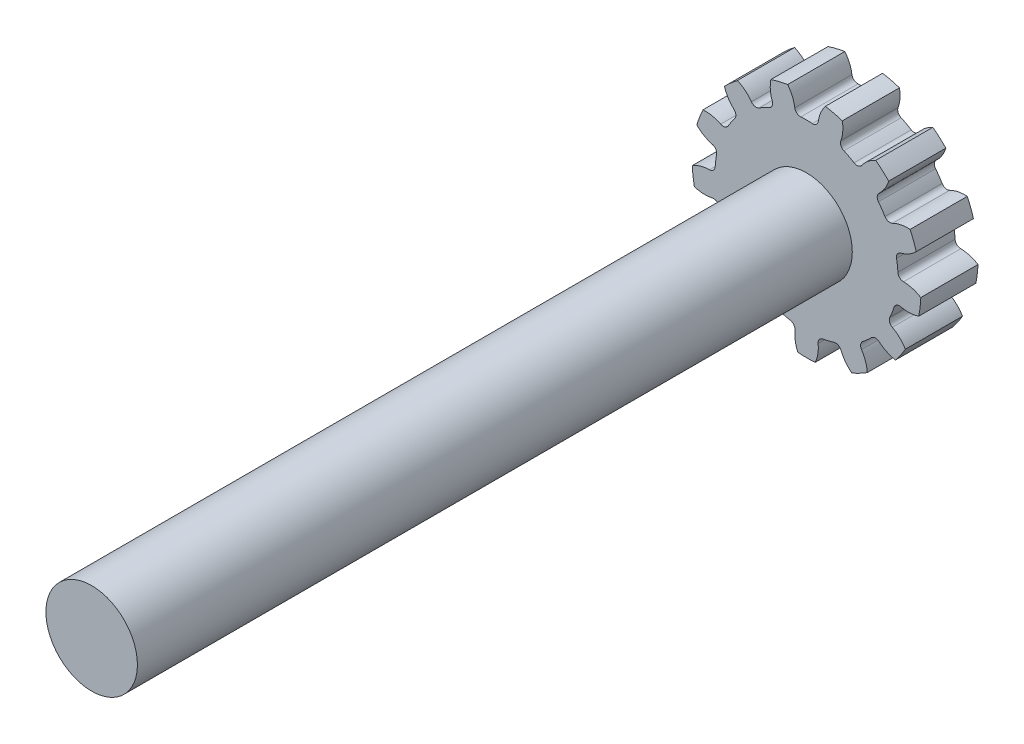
ISO-10303-21;
HEADER;
FILE_DESCRIPTION(('STEP AP214'),'2;1');
FILE_NAME('part.step','',(''),(''),'','','');
FILE_SCHEMA(('AUTOMOTIVE_DESIGN { 1 0 10303 214 1 1 1 1 }'));
ENDSEC;
DATA;
#1=APPLICATION_CONTEXT('core data for automotive mechanical design processes');
#2=APPLICATION_PROTOCOL_DEFINITION('international standard','automotive_design',2000,#1);
#3=PRODUCT_CONTEXT('',#1,'mechanical');
#4=PRODUCT('Part','Part','',(#3));
#5=PRODUCT_RELATED_PRODUCT_CATEGORY('part','',(#4));
#6=PRODUCT_DEFINITION_FORMATION('','',#4);
#7=PRODUCT_DEFINITION_CONTEXT('part definition',#1,'design');
#8=PRODUCT_DEFINITION('design','',#6,#7);
#9=PRODUCT_DEFINITION_SHAPE('','',#8);
#10=(LENGTH_UNIT() NAMED_UNIT(*) SI_UNIT(.MILLI.,.METRE.));
#11=(NAMED_UNIT(*) PLANE_ANGLE_UNIT() SI_UNIT($,.RADIAN.));
#12=(NAMED_UNIT(*) SI_UNIT($,.STERADIAN.) SOLID_ANGLE_UNIT());
#13=UNCERTAINTY_MEASURE_WITH_UNIT(LENGTH_MEASURE(1.E-05),#10,'distance_accuracy_value','');
#14=(GEOMETRIC_REPRESENTATION_CONTEXT(3) GLOBAL_UNCERTAINTY_ASSIGNED_CONTEXT((#13)) GLOBAL_UNIT_ASSIGNED_CONTEXT((#10,
#11,#12)) REPRESENTATION_CONTEXT('',''));
#15=CARTESIAN_POINT('',(0.,0.,0.));
#16=DIRECTION('',(0.,0.,1.));
#17=DIRECTION('',(1.,0.,0.));
#18=AXIS2_PLACEMENT_3D('',#15,#16,#17);
#19=CARTESIAN_POINT('',(0.,0.,50.));
#20=DIRECTION('',(0.,0.,1.));
#21=DIRECTION('',(1.,0.,0.));
#22=AXIS2_PLACEMENT_3D('',#19,#20,#21);
#23=PLANE('',#22);
#24=CARTESIAN_POINT('',(1.7596127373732,89.4254089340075,50.));
#25=DIRECTION('',(0.,0.,-1.));
#26=DIRECTION('',(-0.885456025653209,0.46472317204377,0.));
#27=AXIS2_PLACEMENT_3D('',#24,#25,#26);
#28=CIRCLE('',#27,30.);
#29=CARTESIAN_POINT('',(31.2379328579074,94.995744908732,50.));
#30=VERTEX_POINT('',#29);
#31=CARTESIAN_POINT('',(29.9937934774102,79.2848449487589,50.));
#32=VERTEX_POINT('',#31);
#33=EDGE_CURVE('E908',#30,#32,#28,.T.);
#34=ORIENTED_EDGE('',*,*,#33,.F.);
#35=CARTESIAN_POINT('',(0.,0.,50.));
#36=DIRECTION('',(0.,0.,1.));
#37=DIRECTION('',(1.,0.,0.));
#38=AXIS2_PLACEMENT_3D('',#35,#36,#37);
#39=CIRCLE('',#38,100.);
#40=CARTESIAN_POINT('',(16.4869080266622,98.6315459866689,50.));
#41=VERTEX_POINT('',#40);
#42=EDGE_CURVE('E1054',#30,#41,#39,.T.);
#43=ORIENTED_EDGE('',*,*,#42,.T.);
#44=CARTESIAN_POINT('',(40.,80.,50.));
#45=DIRECTION('',(0.,0.,-1.));
#46=DIRECTION('',(1.,0.,0.));
#47=AXIS2_PLACEMENT_3D('',#44,#45,#46);
#48=CIRCLE('',#47,30.);
#49=CARTESIAN_POINT('',(10.2873194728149,84.1420545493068,50.));
#50=VERTEX_POINT('',#49);
#51=EDGE_CURVE('E1030',#50,#41,#48,.T.);
#52=ORIENTED_EDGE('',*,*,#51,.F.);
#53=CARTESIAN_POINT('',(5.33520605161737,84.8323969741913,50.));
#54=DIRECTION('',(0.,0.,1.));
#55=DIRECTION('',(1.,0.,0.));
#56=AXIS2_PLACEMENT_3D('',#53,#54,#55);
#57=CIRCLE('',#56,5.);
#58=CARTESIAN_POINT('',(5.02137040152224,79.8422559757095,50.));
#59=VERTEX_POINT('',#58);
#60=EDGE_CURVE('E1027',#59,#50,#57,.T.);
#61=ORIENTED_EDGE('',*,*,#60,.F.);
#62=CARTESIAN_POINT('',(0.,0.,50.));
#63=DIRECTION('',(0.,0.,-1.));
#64=DIRECTION('',(1.,0.,0.));
#65=AXIS2_PLACEMENT_3D('',#62,#63,#64);
#66=CIRCLE('',#65,80.);
#67=CARTESIAN_POINT('',(-5.02137040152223,79.8422559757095,50.));
#68=VERTEX_POINT('',#67);
#69=EDGE_CURVE('E1024',#68,#59,#66,.T.);
#70=ORIENTED_EDGE('',*,*,#69,.F.);
#71=CARTESIAN_POINT('',(-5.33520605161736,84.8323969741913,50.));
#72=DIRECTION('',(0.,0.,1.));
#73=DIRECTION('',(-1.,0.,0.));
#74=AXIS2_PLACEMENT_3D('',#71,#72,#73);
#75=CIRCLE('',#74,5.);
#76=CARTESIAN_POINT('',(-10.2873194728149,84.1420545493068,50.));
#77=VERTEX_POINT('',#76);
#78=EDGE_CURVE('E1007',#77,#68,#75,.T.);
#79=ORIENTED_EDGE('',*,*,#78,.F.);
#80=CARTESIAN_POINT('',(-40.,80.,50.));
#81=DIRECTION('',(0.,0.,-1.));
#82=DIRECTION('',(-1.,0.,0.));
#83=AXIS2_PLACEMENT_3D('',#80,#81,#82);
#84=CIRCLE('',#83,30.);
#85=CARTESIAN_POINT('',(-16.4869080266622,98.6315459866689,50.));
#86=VERTEX_POINT('',#85);
#87=EDGE_CURVE('E1012',#86,#77,#84,.T.);
#88=ORIENTED_EDGE('',*,*,#87,.F.);
#89=CARTESIAN_POINT('',(-31.2379328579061,94.9957449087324,50.));
#90=VERTEX_POINT('',#89);
#91=EDGE_CURVE('E1049',#86,#90,#39,.T.);
#92=ORIENTED_EDGE('',*,*,#91,.T.);
#93=CARTESIAN_POINT('',(-1.75961273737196,89.4254089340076,50.));
#94=DIRECTION('',(0.,0.,-1.));
#95=DIRECTION('',(0.885456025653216,0.464723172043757,0.));
#96=AXIS2_PLACEMENT_3D('',#93,#94,#95);
#97=CIRCLE('',#96,30.);
#98=CARTESIAN_POINT('',(-29.9937934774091,79.2848449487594,50.));
#99=VERTEX_POINT('',#98);
#100=EDGE_CURVE('E544',#99,#90,#97,.T.);
#101=ORIENTED_EDGE('',*,*,#100,.F.);
#102=CARTESIAN_POINT('',(-34.6994902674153,77.594750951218,50.));
#103=DIRECTION('',(0.,0.,1.));
#104=DIRECTION('',(0.885456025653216,0.464723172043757,0.));
#105=AXIS2_PLACEMENT_3D('',#102,#103,#104);
#106=CIRCLE('',#105,5.);
#107=CARTESIAN_POINT('',(-32.6583437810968,73.0303538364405,50.));
#108=VERTEX_POINT('',#107);
#109=EDGE_CURVE('E556',#108,#99,#106,.T.);
#110=ORIENTED_EDGE('',*,*,#109,.F.);
#111=CARTESIAN_POINT('',(0.,0.,50.));
#112=DIRECTION('',(0.,0.,-1.));
#113=DIRECTION('',(0.885456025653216,0.464723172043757,0.));
#114=AXIS2_PLACEMENT_3D('',#111,#112,#113);
#115=CIRCLE('',#114,80.);
#116=CARTESIAN_POINT('',(-41.5507491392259,68.3632594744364,50.));
#117=VERTEX_POINT('',#116);
#118=EDGE_CURVE('E554',#117,#108,#115,.T.);
#119=ORIENTED_EDGE('',*,*,#118,.F.);
#120=CARTESIAN_POINT('',(-44.1476709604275,72.6359631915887,50.));
#121=DIRECTION('',(0.,0.,1.));
#122=DIRECTION('',(-0.885456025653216,-0.464723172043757,0.));
#123=AXIS2_PLACEMENT_3D('',#120,#121,#122);
#124=CIRCLE('',#123,5.);
#125=CARTESIAN_POINT('',(-48.2117315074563,69.7233334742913,50.));
#126=VERTEX_POINT('',#125);
#127=EDGE_CURVE('E523',#126,#117,#124,.T.);
#128=ORIENTED_EDGE('',*,*,#127,.F.);
#129=CARTESIAN_POINT('',(-72.5960947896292,52.247555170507,50.));
#130=DIRECTION('',(0.,0.,-1.));
#131=DIRECTION('',(-0.885456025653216,-0.464723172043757,0.));
#132=AXIS2_PLACEMENT_3D('',#129,#130,#131);
#133=CIRCLE('',#132,30.);
#134=CARTESIAN_POINT('',(-60.4347969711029,79.6720485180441,50.));
#135=VERTEX_POINT('',#134);
#136=EDGE_CURVE('E542',#135,#126,#133,.T.);
#137=ORIENTED_EDGE('',*,*,#136,.F.);
#138=CARTESIAN_POINT('',(-71.8065397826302,69.5975634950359,50.));
#139=VERTEX_POINT('',#138);
#140=EDGE_CURVE('E1053',#135,#139,#39,.T.);
#141=ORIENTED_EDGE('',*,*,#140,.T.);
#142=CARTESIAN_POINT('',(-43.1161194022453,78.3645343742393,50.));
#143=DIRECTION('',(0.,0.,-1.));
#144=DIRECTION('',(0.568064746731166,0.822983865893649,0.));
#145=AXIS2_PLACEMENT_3D('',#142,#143,#144);
#146=CIRCLE('',#145,30.);
#147=CARTESIAN_POINT('',(-63.4036898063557,56.2644328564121,50.));
#148=VERTEX_POINT('',#147);
#149=EDGE_CURVE('E588',#148,#139,#146,.T.);
#150=ORIENTED_EDGE('',*,*,#149,.F.);
#151=CARTESIAN_POINT('',(-66.7849515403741,52.581082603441,50.));
#152=DIRECTION('',(0.,0.,1.));
#153=DIRECTION('',(0.568064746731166,0.822983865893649,0.));
#154=AXIS2_PLACEMENT_3D('',#151,#152,#153);
#155=CIRCLE('',#154,5.);
#156=CARTESIAN_POINT('',(-62.8564249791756,49.488077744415,50.));
#157=VERTEX_POINT('',#156);
#158=EDGE_CURVE('E585',#157,#148,#155,.T.);
#159=ORIENTED_EDGE('',*,*,#158,.F.);
#160=CARTESIAN_POINT('',(0.,0.,50.));
#161=DIRECTION('',(0.,0.,-1.));
#162=DIRECTION('',(0.568064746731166,0.822983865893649,0.));
#163=AXIS2_PLACEMENT_3D('',#160,#161,#162);
#164=CIRCLE('',#163,80.);
#165=CARTESIAN_POINT('',(-68.5613519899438,41.2230640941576,50.));
#166=VERTEX_POINT('',#165);
#167=EDGE_CURVE('E582',#166,#157,#164,.T.);
#168=ORIENTED_EDGE('',*,*,#167,.F.);
#169=CARTESIAN_POINT('',(-72.8464364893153,43.7995056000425,50.));
#170=DIRECTION('',(0.,0.,1.));
#171=DIRECTION('',(-0.568064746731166,-0.822983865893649,0.));
#172=AXIS2_PLACEMENT_3D('',#169,#170,#171);
#173=CIRCLE('',#172,5.);
#174=CARTESIAN_POINT('',(-75.09141686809,39.3318369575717,50.));
#175=VERTEX_POINT('',#174);
#176=EDGE_CURVE('E562',#175,#166,#173,.T.);
#177=ORIENTED_EDGE('',*,*,#176,.F.);
#178=CARTESIAN_POINT('',(-88.5612991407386,12.5258251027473,50.));
#179=DIRECTION('',(0.,0.,-1.));
#180=DIRECTION('',(-0.568064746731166,-0.822983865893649,0.));
#181=AXIS2_PLACEMENT_3D('',#178,#179,#180);
#182=CIRCLE('',#181,30.);
#183=CARTESIAN_POINT('',(-90.5378022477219,42.4606448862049,50.));
#184=VERTEX_POINT('',#183);
#185=EDGE_CURVE('E570',#184,#175,#182,.T.);
#186=ORIENTED_EDGE('',*,*,#185,.F.);
#187=CARTESIAN_POINT('',(-95.9251338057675,28.2554190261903,50.));
#188=VERTEX_POINT('',#187);
#189=EDGE_CURVE('E1166',#184,#188,#39,.T.);
#190=ORIENTED_EDGE('',*,*,#189,.T.);
#191=CARTESIAN_POINT('',(-74.5952427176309,49.3512893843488,50.));
#192=DIRECTION('',(0.,0.,-1.));
#193=DIRECTION('',(0.120536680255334,0.992708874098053,0.));
#194=AXIS2_PLACEMENT_3D('',#191,#192,#193);
#195=CIRCLE('',#194,30.);
#196=CARTESIAN_POINT('',(-82.2885648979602,20.3545172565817,50.));
#197=VERTEX_POINT('',#196);
#198=EDGE_CURVE('E622',#197,#188,#195,.T.);
#199=ORIENTED_EDGE('',*,*,#198,.F.);
#200=CARTESIAN_POINT('',(-83.5707852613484,15.5217219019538,50.));
#201=DIRECTION('',(0.,0.,1.));
#202=DIRECTION('',(0.120536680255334,0.992708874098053,0.));
#203=AXIS2_PLACEMENT_3D('',#200,#201,#202);
#204=CIRCLE('',#203,5.);
#205=CARTESIAN_POINT('',(-78.6548567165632,14.608679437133,50.));
#206=VERTEX_POINT('',#205);
#207=EDGE_CURVE('E619',#206,#197,#204,.T.);
#208=ORIENTED_EDGE('',*,*,#207,.F.);
#209=CARTESIAN_POINT('',(0.,0.,50.));
#210=DIRECTION('',(0.,0.,-1.));
#211=DIRECTION('',(0.120536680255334,0.992708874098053,0.));
#212=AXIS2_PLACEMENT_3D('',#209,#210,#211);
#213=CIRCLE('',#212,80.);
#214=CARTESIAN_POINT('',(-79.865375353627,4.63916152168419,50.));
#215=VERTEX_POINT('',#214);
#216=EDGE_CURVE('E616',#215,#206,#213,.T.);
#217=ORIENTED_EDGE('',*,*,#216,.F.);
#218=CARTESIAN_POINT('',(-84.8569613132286,4.92910911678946,50.));
#219=DIRECTION('',(0.,0.,1.));
#220=DIRECTION('',(-0.120536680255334,-0.992708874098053,0.));
#221=AXIS2_PLACEMENT_3D('',#218,#219,#220);
#222=CIRCLE('',#221,5.);
#223=CARTESIAN_POINT('',(-84.7685635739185,-0.0701094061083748,50.));
#224=VERTEX_POINT('',#223);
#225=EDGE_CURVE('E594',#224,#215,#222,.T.);
#226=ORIENTED_EDGE('',*,*,#225,.F.);
#227=CARTESIAN_POINT('',(-84.2381771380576,-30.0654205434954,50.));
#228=DIRECTION('',(0.,0.,-1.));
#229=DIRECTION('',(-0.120536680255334,-0.992708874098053,0.));
#230=AXIS2_PLACEMENT_3D('',#227,#228,#229);
#231=CIRCLE('',#230,30.);
#232=CARTESIAN_POINT('',(-99.8996881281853,-4.47798078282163,50.));
#233=VERTEX_POINT('',#232);
#234=EDGE_CURVE('E604',#233,#224,#231,.T.);
#235=ORIENTED_EDGE('',*,*,#234,.F.);
#236=CARTESIAN_POINT('',(-98.0684356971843,-19.5597014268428,50.));
#237=VERTEX_POINT('',#236);
#238=EDGE_CURVE('E1168',#233,#237,#39,.T.);
#239=ORIENTED_EDGE('',*,*,#238,.T.);
#240=CARTESIAN_POINT('',(-88.9854948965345,9.03225874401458,50.));
#241=DIRECTION('',(0.,0.,-1.));
#242=DIRECTION('',(-0.354604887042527,0.935016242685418,0.));
#243=AXIS2_PLACEMENT_3D('',#240,#241,#242);
#244=CIRCLE('',#243,30.);
#245=CARTESIAN_POINT('',(-82.3221214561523,-20.2183729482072,50.));
#246=VERTEX_POINT('',#245);
#247=EDGE_CURVE('E656',#246,#237,#244,.T.);
#248=ORIENTED_EDGE('',*,*,#247,.F.);
#249=CARTESIAN_POINT('',(-81.2115592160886,-25.0934782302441,50.));
#250=DIRECTION('',(0.,0.,1.));
#251=DIRECTION('',(-0.354604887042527,0.935016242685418,0.));
#252=AXIS2_PLACEMENT_3D('',#249,#250,#251);
#253=CIRCLE('',#252,5.);
#254=CARTESIAN_POINT('',(-76.4344086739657,-23.6173912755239,50.));
#255=VERTEX_POINT('',#254);
#256=EDGE_CURVE('E653',#255,#246,#253,.T.);
#257=ORIENTED_EDGE('',*,*,#256,.F.);
#258=CARTESIAN_POINT('',(0.,0.,50.));
#259=DIRECTION('',(0.,0.,-1.));
#260=DIRECTION('',(-0.354604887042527,0.935016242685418,0.));
#261=AXIS2_PLACEMENT_3D('',#258,#259,#260);
#262=CIRCLE('',#261,80.);
#263=CARTESIAN_POINT('',(-72.8732037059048,-33.0075170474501,50.));
#264=VERTEX_POINT('',#263);
#265=EDGE_CURVE('E650',#264,#255,#262,.T.);
#266=ORIENTED_EDGE('',*,*,#265,.F.);
#267=CARTESIAN_POINT('',(-77.4277789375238,-35.0704868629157,50.));
#268=DIRECTION('',(0.,0.,1.));
#269=DIRECTION('',(0.354604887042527,-0.935016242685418,0.));
#270=AXIS2_PLACEMENT_3D('',#267,#268,#269);
#271=CIRCLE('',#270,5.);
#272=CARTESIAN_POINT('',(-75.0262539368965,-39.455994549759,50.));
#273=VERTEX_POINT('',#272);
#274=EDGE_CURVE('E628',#273,#264,#271,.T.);
#275=ORIENTED_EDGE('',*,*,#274,.F.);
#276=CARTESIAN_POINT('',(-60.6171039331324,-65.7690406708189,50.));
#277=DIRECTION('',(0.,0.,-1.));
#278=DIRECTION('',(0.354604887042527,-0.935016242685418,0.));
#279=AXIS2_PLACEMENT_3D('',#276,#277,#278);
#280=CIRCLE('',#279,30.);
#281=CARTESIAN_POINT('',(-86.3757593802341,-50.3907550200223,50.));
#282=VERTEX_POINT('',#281);
#283=EDGE_CURVE('E638',#282,#273,#280,.T.);
#284=ORIENTED_EDGE('',*,*,#283,.F.);
#285=CARTESIAN_POINT('',(-77.7454408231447,-62.8939300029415,50.));
#286=VERTEX_POINT('',#285);
#287=EDGE_CURVE('E1173',#282,#286,#39,.T.);
#288=ORIENTED_EDGE('',*,*,#287,.T.);
#289=CARTESIAN_POINT('',(-82.990242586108,-33.3559535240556,50.));
#290=DIRECTION('',(0.,0.,-1.));
#291=DIRECTION('',(-0.748510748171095,0.663122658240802,0.));
#292=AXIS2_PLACEMENT_3D('',#289,#290,#291);
#293=CIRCLE('',#292,30.);
#294=CARTESIAN_POINT('',(-63.4966720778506,-56.1594775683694,50.));
#295=VERTEX_POINT('',#294);
#296=EDGE_CURVE('E690',#295,#286,#293,.T.);
#297=ORIENTED_EDGE('',*,*,#296,.F.);
#298=CARTESIAN_POINT('',(-60.2477436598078,-59.9600649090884,50.));
#299=DIRECTION('',(0.,0.,1.));
#300=DIRECTION('',(-0.748510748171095,0.663122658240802,0.));
#301=AXIS2_PLACEMENT_3D('',#298,#299,#300);
#302=CIRCLE('',#301,5.);
#303=CARTESIAN_POINT('',(-56.7037587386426,-56.4330022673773,50.));
#304=VERTEX_POINT('',#303);
#305=EDGE_CURVE('E687',#304,#295,#302,.T.);
#306=ORIENTED_EDGE('',*,*,#305,.F.);
#307=CARTESIAN_POINT('',(0.,0.,50.));
#308=DIRECTION('',(0.,0.,-1.));
#309=DIRECTION('',(-0.748510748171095,0.663122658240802,0.));
#310=AXIS2_PLACEMENT_3D('',#307,#308,#309);
#311=CIRCLE('',#310,80.);
#312=CARTESIAN_POINT('',(-49.1866593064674,-63.0925712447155,50.));
#313=VERTEX_POINT('',#312);
#314=EDGE_CURVE('E684',#313,#304,#311,.T.);
#315=ORIENTED_EDGE('',*,*,#314,.F.);
#316=CARTESIAN_POINT('',(-52.2608255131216,-67.0358569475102,50.));
#317=DIRECTION('',(0.,0.,1.));
#318=DIRECTION('',(0.748510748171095,-0.663122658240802,0.));
#319=AXIS2_PLACEMENT_3D('',#316,#317,#318);
#320=CIRCLE('',#319,5.);
#321=CARTESIAN_POINT('',(-48.0963336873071,-69.8029868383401,50.));
#322=VERTEX_POINT('',#321);
#323=EDGE_CURVE('E662',#322,#313,#320,.T.);
#324=ORIENTED_EDGE('',*,*,#323,.F.);
#325=CARTESIAN_POINT('',(-23.1093827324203,-86.4057661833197,50.));
#326=DIRECTION('',(0.,0.,-1.));
#327=DIRECTION('',(0.748510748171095,-0.663122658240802,0.));
#328=AXIS2_PLACEMENT_3D('',#325,#326,#327);
#329=CIRCLE('',#328,30.);
#330=CARTESIAN_POINT('',(-53.0641850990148,-84.7596145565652,50.));
#331=VERTEX_POINT('',#330);
#332=EDGE_CURVE('E672',#331,#322,#329,.T.);
#333=ORIENTED_EDGE('',*,*,#332,.F.);
#334=CARTESIAN_POINT('',(-39.6119023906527,-91.8199171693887,50.));
#335=VERTEX_POINT('',#334);
#336=EDGE_CURVE('E1178',#331,#335,#39,.T.);
#337=ORIENTED_EDGE('',*,*,#336,.T.);
#338=CARTESIAN_POINT('',(-57.9829258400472,-68.1027188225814,50.));
#339=DIRECTION('',(0.,0.,-1.));
#340=DIRECTION('',(-0.97094181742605,0.239315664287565,0.));
#341=AXIS2_PLACEMENT_3D('',#338,#339,#340);
#342=CIRCLE('',#341,30.);
#343=CARTESIAN_POINT('',(-30.1249003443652,-79.2351226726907,50.));
#344=VERTEX_POINT('',#343);
#345=EDGE_CURVE('E724',#344,#335,#342,.T.);
#346=ORIENTED_EDGE('',*,*,#345,.F.);
#347=CARTESIAN_POINT('',(-25.4818960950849,-81.0905233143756,50.));
#348=DIRECTION('',(0.,0.,1.));
#349=DIRECTION('',(-0.97094181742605,0.239315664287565,0.));
#350=AXIS2_PLACEMENT_3D('',#347,#348,#349);
#351=CIRCLE('',#350,5.);
#352=CARTESIAN_POINT('',(-23.9829610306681,-76.3204925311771,50.));
#353=VERTEX_POINT('',#352);
#354=EDGE_CURVE('E721',#353,#344,#351,.T.);
#355=ORIENTED_EDGE('',*,*,#354,.F.);
#356=CARTESIAN_POINT('',(0.,0.,50.));
#357=DIRECTION('',(0.,0.,-1.));
#358=DIRECTION('',(-0.97094181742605,0.239315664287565,0.));
#359=AXIS2_PLACEMENT_3D('',#356,#357,#358);
#360=CIRCLE('',#359,80.);
#361=CARTESIAN_POINT('',(-14.2320440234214,-78.7238777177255,50.));
#362=VERTEX_POINT('',#361);
#363=EDGE_CURVE('E718',#362,#353,#360,.T.);
#364=ORIENTED_EDGE('',*,*,#363,.F.);
#365=CARTESIAN_POINT('',(-15.1215467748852,-83.6441200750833,50.));
#366=DIRECTION('',(0.,0.,1.));
#367=DIRECTION('',(0.97094181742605,-0.239315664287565,0.));
#368=AXIS2_PLACEMENT_3D('',#365,#366,#367);
#369=CIRCLE('',#368,5.);
#370=CARTESIAN_POINT('',(-10.1481230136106,-84.1589560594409,50.));
#371=VERTEX_POINT('',#370);
#372=EDGE_CURVE('E696',#371,#362,#369,.T.);
#373=ORIENTED_EDGE('',*,*,#372,.F.);
#374=CARTESIAN_POINT('',(19.6924195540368,-87.2479719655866,50.));
#375=DIRECTION('',(0.,0.,-1.));
#376=DIRECTION('',(0.97094181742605,-0.239315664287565,0.));
#377=AXIS2_PLACEMENT_3D('',#374,#375,#376);
#378=CIRCLE('',#377,30.);
#379=CARTESIAN_POINT('',(-7.59624550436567,-99.711067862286,50.));
#380=VERTEX_POINT('',#379);
#381=EDGE_CURVE('E706',#380,#371,#378,.T.);
#382=ORIENTED_EDGE('',*,*,#381,.F.);
#383=CARTESIAN_POINT('',(7.59624550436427,-99.7110678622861,50.));
#384=VERTEX_POINT('',#383);
#385=EDGE_CURVE('E1183',#380,#384,#39,.T.);
#386=ORIENTED_EDGE('',*,*,#385,.T.);
#387=CARTESIAN_POINT('',(-19.692419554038,-87.2479719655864,50.));
#388=DIRECTION('',(0.,0.,-1.));
#389=DIRECTION('',(-0.970941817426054,-0.239315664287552,0.));
#390=AXIS2_PLACEMENT_3D('',#387,#388,#389);
#391=CIRCLE('',#390,30.);
#392=CARTESIAN_POINT('',(10.1481230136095,-84.1589560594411,50.));
#393=VERTEX_POINT('',#392);
#394=EDGE_CURVE('E758',#393,#384,#391,.T.);
#395=ORIENTED_EDGE('',*,*,#394,.F.);
#396=CARTESIAN_POINT('',(15.121546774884,-83.6441200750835,50.));
#397=DIRECTION('',(0.,0.,1.));
#398=DIRECTION('',(-0.970941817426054,-0.239315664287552,0.));
#399=AXIS2_PLACEMENT_3D('',#396,#397,#398);
#400=CIRCLE('',#399,5.);
#401=CARTESIAN_POINT('',(14.2320440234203,-78.7238777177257,50.));
#402=VERTEX_POINT('',#401);
#403=EDGE_CURVE('E755',#402,#393,#400,.T.);
#404=ORIENTED_EDGE('',*,*,#403,.F.);
#405=CARTESIAN_POINT('',(0.,0.,50.));
#406=DIRECTION('',(0.,0.,-1.));
#407=DIRECTION('',(-0.970941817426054,-0.239315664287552,0.));
#408=AXIS2_PLACEMENT_3D('',#405,#406,#407);
#409=CIRCLE('',#408,80.);
#410=CARTESIAN_POINT('',(23.982961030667,-76.3204925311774,50.));
#411=VERTEX_POINT('',#410);
#412=EDGE_CURVE('E752',#411,#402,#409,.T.);
#413=ORIENTED_EDGE('',*,*,#412,.F.);
#414=CARTESIAN_POINT('',(25.4818960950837,-81.090523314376,50.));
#415=DIRECTION('',(0.,0.,1.));
#416=DIRECTION('',(0.970941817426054,0.239315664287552,0.));
#417=AXIS2_PLACEMENT_3D('',#414,#415,#416);
#418=CIRCLE('',#417,5.);
#419=CARTESIAN_POINT('',(30.1249003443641,-79.2351226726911,50.));
#420=VERTEX_POINT('',#419);
#421=EDGE_CURVE('E730',#420,#411,#418,.T.);
#422=ORIENTED_EDGE('',*,*,#421,.F.);
#423=CARTESIAN_POINT('',(57.9829258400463,-68.1027188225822,50.));
#424=DIRECTION('',(0.,0.,-1.));
#425=DIRECTION('',(0.970941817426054,0.239315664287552,0.));
#426=AXIS2_PLACEMENT_3D('',#423,#424,#425);
#427=CIRCLE('',#426,30.);
#428=CARTESIAN_POINT('',(39.6119023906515,-91.8199171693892,50.));
#429=VERTEX_POINT('',#428);
#430=EDGE_CURVE('E740',#429,#420,#427,.T.);
#431=ORIENTED_EDGE('',*,*,#430,.F.);
#432=CARTESIAN_POINT('',(53.0641850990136,-84.7596145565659,50.));
#433=VERTEX_POINT('',#432);
#434=EDGE_CURVE('E1188',#429,#433,#39,.T.);
#435=ORIENTED_EDGE('',*,*,#434,.T.);
#436=CARTESIAN_POINT('',(23.1093827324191,-86.4057661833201,50.));
#437=DIRECTION('',(0.,0.,-1.));
#438=DIRECTION('',(-0.748510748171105,-0.663122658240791,0.));
#439=AXIS2_PLACEMENT_3D('',#436,#437,#438);
#440=CIRCLE('',#439,30.);
#441=CARTESIAN_POINT('',(48.0963336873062,-69.8029868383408,50.));
#442=VERTEX_POINT('',#441);
#443=EDGE_CURVE('E792',#442,#433,#440,.T.);
#444=ORIENTED_EDGE('',*,*,#443,.F.);
#445=CARTESIAN_POINT('',(52.2608255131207,-67.035856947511,50.));
#446=DIRECTION('',(0.,0.,1.));
#447=DIRECTION('',(-0.748510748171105,-0.663122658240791,0.));
#448=AXIS2_PLACEMENT_3D('',#445,#446,#447);
#449=CIRCLE('',#448,5.);
#450=CARTESIAN_POINT('',(49.1866593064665,-63.0925712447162,50.));
#451=VERTEX_POINT('',#450);
#452=EDGE_CURVE('E789',#451,#442,#449,.T.);
#453=ORIENTED_EDGE('',*,*,#452,.F.);
#454=CARTESIAN_POINT('',(0.,0.,50.));
#455=DIRECTION('',(0.,0.,-1.));
#456=DIRECTION('',(-0.748510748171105,-0.663122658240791,0.));
#457=AXIS2_PLACEMENT_3D('',#454,#455,#456);
#458=CIRCLE('',#457,80.);
#459=CARTESIAN_POINT('',(56.7037587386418,-56.4330022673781,50.));
#460=VERTEX_POINT('',#459);
#461=EDGE_CURVE('E786',#460,#451,#458,.T.);
#462=ORIENTED_EDGE('',*,*,#461,.F.);
#463=CARTESIAN_POINT('',(60.2477436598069,-59.9600649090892,50.));
#464=DIRECTION('',(0.,0.,1.));
#465=DIRECTION('',(0.748510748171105,0.663122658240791,0.));
#466=AXIS2_PLACEMENT_3D('',#463,#464,#465);
#467=CIRCLE('',#466,5.);
#468=CARTESIAN_POINT('',(63.4966720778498,-56.1594775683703,50.));
#469=VERTEX_POINT('',#468);
#470=EDGE_CURVE('E764',#469,#460,#467,.T.);
#471=ORIENTED_EDGE('',*,*,#470,.F.);
#472=CARTESIAN_POINT('',(82.9902425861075,-33.3559535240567,50.));
#473=DIRECTION('',(0.,0.,-1.));
#474=DIRECTION('',(0.748510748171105,0.663122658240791,0.));
#475=AXIS2_PLACEMENT_3D('',#472,#473,#474);
#476=CIRCLE('',#475,30.);
#477=CARTESIAN_POINT('',(77.7454408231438,-62.8939300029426,50.));
#478=VERTEX_POINT('',#477);
#479=EDGE_CURVE('E774',#478,#469,#476,.T.);
#480=ORIENTED_EDGE('',*,*,#479,.F.);
#481=CARTESIAN_POINT('',(86.3757593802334,-50.3907550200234,50.));
#482=VERTEX_POINT('',#481);
#483=EDGE_CURVE('E1193',#478,#482,#39,.T.);
#484=ORIENTED_EDGE('',*,*,#483,.T.);
#485=CARTESIAN_POINT('',(60.6171039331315,-65.7690406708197,50.));
#486=DIRECTION('',(0.,0.,-1.));
#487=DIRECTION('',(-0.35460488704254,-0.935016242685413,0.));
#488=AXIS2_PLACEMENT_3D('',#485,#486,#487);
#489=CIRCLE('',#488,30.);
#490=CARTESIAN_POINT('',(75.0262539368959,-39.45599454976,50.));
#491=VERTEX_POINT('',#490);
#492=EDGE_CURVE('E826',#491,#482,#489,.T.);
#493=ORIENTED_EDGE('',*,*,#492,.F.);
#494=CARTESIAN_POINT('',(77.4277789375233,-35.0704868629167,50.));
#495=DIRECTION('',(0.,0.,1.));
#496=DIRECTION('',(-0.35460488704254,-0.935016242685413,0.));
#497=AXIS2_PLACEMENT_3D('',#494,#495,#496);
#498=CIRCLE('',#497,5.);
#499=CARTESIAN_POINT('',(72.8732037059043,-33.0075170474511,50.));
#500=VERTEX_POINT('',#499);
#501=EDGE_CURVE('E823',#500,#491,#498,.T.);
#502=ORIENTED_EDGE('',*,*,#501,.F.);
#503=CARTESIAN_POINT('',(0.,0.,50.));
#504=DIRECTION('',(0.,0.,-1.));
#505=DIRECTION('',(-0.35460488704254,-0.935016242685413,0.));
#506=AXIS2_PLACEMENT_3D('',#503,#504,#505);
#507=CIRCLE('',#506,80.);
#508=CARTESIAN_POINT('',(76.4344086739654,-23.6173912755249,50.));
#509=VERTEX_POINT('',#508);
#510=EDGE_CURVE('E820',#509,#500,#507,.T.);
#511=ORIENTED_EDGE('',*,*,#510,.F.);
#512=CARTESIAN_POINT('',(81.2115592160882,-25.0934782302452,50.));
#513=DIRECTION('',(0.,0.,1.));
#514=DIRECTION('',(0.35460488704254,0.935016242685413,0.));
#515=AXIS2_PLACEMENT_3D('',#512,#513,#514);
#516=CIRCLE('',#515,5.);
#517=CARTESIAN_POINT('',(82.322121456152,-20.2183729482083,50.));
#518=VERTEX_POINT('',#517);
#519=EDGE_CURVE('E798',#518,#509,#516,.T.);
#520=ORIENTED_EDGE('',*,*,#519,.F.);
#521=CARTESIAN_POINT('',(88.9854948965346,9.03225874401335,50.));
#522=DIRECTION('',(0.,0.,-1.));
#523=DIRECTION('',(0.35460488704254,0.935016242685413,0.));
#524=AXIS2_PLACEMENT_3D('',#521,#522,#523);
#525=CIRCLE('',#524,30.);
#526=CARTESIAN_POINT('',(98.068435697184,-19.5597014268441,50.));
#527=VERTEX_POINT('',#526);
#528=EDGE_CURVE('E808',#527,#518,#525,.T.);
#529=ORIENTED_EDGE('',*,*,#528,.F.);
#530=CARTESIAN_POINT('',(99.8996881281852,-4.47798078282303,50.));
#531=VERTEX_POINT('',#530);
#532=EDGE_CURVE('E1105',#527,#531,#39,.T.);
#533=ORIENTED_EDGE('',*,*,#532,.T.);
#534=CARTESIAN_POINT('',(84.2381771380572,-30.0654205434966,50.));
#535=DIRECTION('',(0.,0.,-1.));
#536=DIRECTION('',(0.12053668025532,-0.992708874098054,0.));
#537=AXIS2_PLACEMENT_3D('',#534,#535,#536);
#538=CIRCLE('',#537,30.);
#539=CARTESIAN_POINT('',(84.7685635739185,-0.0701094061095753,50.));
#540=VERTEX_POINT('',#539);
#541=EDGE_CURVE('E860',#540,#531,#538,.T.);
#542=ORIENTED_EDGE('',*,*,#541,.F.);
#543=CARTESIAN_POINT('',(84.8569613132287,4.92910911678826,50.));
#544=DIRECTION('',(0.,0.,1.));
#545=DIRECTION('',(0.12053668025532,-0.992708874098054,0.));
#546=AXIS2_PLACEMENT_3D('',#543,#544,#545);
#547=CIRCLE('',#546,5.);
#548=CARTESIAN_POINT('',(79.865375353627,4.63916152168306,50.));
#549=VERTEX_POINT('',#548);
#550=EDGE_CURVE('E857',#549,#540,#547,.T.);
#551=ORIENTED_EDGE('',*,*,#550,.F.);
#552=CARTESIAN_POINT('',(0.,0.,50.));
#553=DIRECTION('',(0.,0.,-1.));
#554=DIRECTION('',(0.12053668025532,-0.992708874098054,0.));
#555=AXIS2_PLACEMENT_3D('',#552,#553,#554);
#556=CIRCLE('',#555,80.);
#557=CARTESIAN_POINT('',(78.6548567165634,14.6086794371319,50.));
#558=VERTEX_POINT('',#557);
#559=EDGE_CURVE('E854',#558,#549,#556,.T.);
#560=ORIENTED_EDGE('',*,*,#559,.F.);
#561=CARTESIAN_POINT('',(83.5707852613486,15.5217219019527,50.));
#562=DIRECTION('',(0.,0.,1.));
#563=DIRECTION('',(-0.12053668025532,0.992708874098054,0.));
#564=AXIS2_PLACEMENT_3D('',#561,#562,#563);
#565=CIRCLE('',#564,5.);
#566=CARTESIAN_POINT('',(82.2885648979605,20.3545172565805,50.));
#567=VERTEX_POINT('',#566);
#568=EDGE_CURVE('E832',#567,#558,#565,.T.);
#569=ORIENTED_EDGE('',*,*,#568,.F.);
#570=CARTESIAN_POINT('',(74.5952427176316,49.3512893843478,50.));
#571=DIRECTION('',(0.,0.,-1.));
#572=DIRECTION('',(-0.12053668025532,0.992708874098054,0.));
#573=AXIS2_PLACEMENT_3D('',#570,#571,#572);
#574=CIRCLE('',#573,30.);
#575=CARTESIAN_POINT('',(95.9251338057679,28.255419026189,50.));
#576=VERTEX_POINT('',#575);
#577=EDGE_CURVE('E842',#576,#567,#574,.T.);
#578=ORIENTED_EDGE('',*,*,#577,.F.);
#579=CARTESIAN_POINT('',(90.5378022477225,42.4606448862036,50.));
#580=VERTEX_POINT('',#579);
#581=EDGE_CURVE('E1103',#576,#580,#39,.T.);
#582=ORIENTED_EDGE('',*,*,#581,.T.);
#583=CARTESIAN_POINT('',(88.5612991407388,12.525825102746,50.));
#584=DIRECTION('',(0.,0.,-1.));
#585=DIRECTION('',(0.568064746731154,-0.822983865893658,0.));
#586=AXIS2_PLACEMENT_3D('',#583,#584,#585);
#587=CIRCLE('',#586,30.);
#588=CARTESIAN_POINT('',(75.0914168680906,39.3318369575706,50.));
#589=VERTEX_POINT('',#588);
#590=EDGE_CURVE('E892',#589,#580,#587,.T.);
#591=ORIENTED_EDGE('',*,*,#590,.F.);
#592=CARTESIAN_POINT('',(72.8464364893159,43.7995056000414,50.));
#593=DIRECTION('',(0.,0.,1.));
#594=DIRECTION('',(0.568064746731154,-0.822983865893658,0.));
#595=AXIS2_PLACEMENT_3D('',#592,#593,#594);
#596=CIRCLE('',#595,5.);
#597=CARTESIAN_POINT('',(68.5613519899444,41.2230640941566,50.));
#598=VERTEX_POINT('',#597);
#599=EDGE_CURVE('E889',#598,#589,#596,.T.);
#600=ORIENTED_EDGE('',*,*,#599,.F.);
#601=CARTESIAN_POINT('',(0.,0.,50.));
#602=DIRECTION('',(0.,0.,-1.));
#603=DIRECTION('',(0.568064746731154,-0.822983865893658,0.));
#604=AXIS2_PLACEMENT_3D('',#601,#602,#603);
#605=CIRCLE('',#604,80.);
#606=CARTESIAN_POINT('',(62.8564249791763,49.4880777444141,50.));
#607=VERTEX_POINT('',#606);
#608=EDGE_CURVE('E886',#607,#598,#605,.T.);
#609=ORIENTED_EDGE('',*,*,#608,.F.);
#610=CARTESIAN_POINT('',(66.7849515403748,52.58108260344,50.));
#611=DIRECTION('',(0.,0.,1.));
#612=DIRECTION('',(-0.568064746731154,0.822983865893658,0.));
#613=AXIS2_PLACEMENT_3D('',#610,#611,#612);
#614=CIRCLE('',#613,5.);
#615=CARTESIAN_POINT('',(63.4036898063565,56.2644328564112,50.));
#616=VERTEX_POINT('',#615);
#617=EDGE_CURVE('E866',#616,#607,#614,.T.);
#618=ORIENTED_EDGE('',*,*,#617,.F.);
#619=CARTESIAN_POINT('',(43.1161194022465,78.3645343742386,50.));
#620=DIRECTION('',(0.,0.,-1.));
#621=DIRECTION('',(-0.568064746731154,0.822983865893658,0.));
#622=AXIS2_PLACEMENT_3D('',#619,#620,#621);
#623=CIRCLE('',#622,30.);
#624=CARTESIAN_POINT('',(71.8065397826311,69.5975634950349,50.));
#625=VERTEX_POINT('',#624);
#626=EDGE_CURVE('E876',#625,#616,#623,.T.);
#627=ORIENTED_EDGE('',*,*,#626,.F.);
#628=CARTESIAN_POINT('',(60.434796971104,79.6720485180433,50.));
#629=VERTEX_POINT('',#628);
#630=EDGE_CURVE('E1100',#625,#629,#39,.T.);
#631=ORIENTED_EDGE('',*,*,#630,.T.);
#632=CARTESIAN_POINT('',(72.5960947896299,52.247555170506,50.));
#633=DIRECTION('',(0.,0.,-1.));
#634=DIRECTION('',(0.885456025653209,-0.46472317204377,0.));
#635=AXIS2_PLACEMENT_3D('',#632,#633,#634);
#636=CIRCLE('',#635,30.);
#637=CARTESIAN_POINT('',(48.2117315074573,69.7233334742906,50.));
#638=VERTEX_POINT('',#637);
#639=EDGE_CURVE('E924',#638,#629,#636,.T.);
#640=ORIENTED_EDGE('',*,*,#639,.F.);
#641=CARTESIAN_POINT('',(44.1476709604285,72.635963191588,50.));
#642=DIRECTION('',(0.,0.,1.));
#643=DIRECTION('',(0.885456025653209,-0.46472317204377,0.));
#644=AXIS2_PLACEMENT_3D('',#641,#642,#643);
#645=CIRCLE('',#644,5.);
#646=CARTESIAN_POINT('',(41.5507491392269,68.3632594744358,50.));
#647=VERTEX_POINT('',#646);
#648=EDGE_CURVE('E921',#647,#638,#645,.T.);
#649=ORIENTED_EDGE('',*,*,#648,.F.);
#650=CARTESIAN_POINT('',(0.,0.,50.));
#651=DIRECTION('',(0.,0.,-1.));
#652=DIRECTION('',(0.885456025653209,-0.46472317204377,0.));
#653=AXIS2_PLACEMENT_3D('',#650,#651,#652);
#654=CIRCLE('',#653,80.);
#655=CARTESIAN_POINT('',(32.6583437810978,73.03035383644,50.));
#656=VERTEX_POINT('',#655);
#657=EDGE_CURVE('E918',#656,#647,#654,.T.);
#658=ORIENTED_EDGE('',*,*,#657,.F.);
#659=CARTESIAN_POINT('',(34.6994902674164,77.5947509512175,50.));
#660=DIRECTION('',(0.,0.,1.));
#661=DIRECTION('',(-0.885456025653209,0.46472317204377,0.));
#662=AXIS2_PLACEMENT_3D('',#659,#660,#661);
#663=CIRCLE('',#662,5.);
#664=EDGE_CURVE('E898',#32,#656,#663,.T.);
#665=ORIENTED_EDGE('',*,*,#664,.F.);
#666=EDGE_LOOP('',(#34,#43,#52,#61,#70,#79,#88,#92,#101,#110,#119,#128,#137,#141,#150,#159,#168,
#177,#186,#190,#199,#208,#217,#226,#235,#239,#248,#257,#266,#275,#284,#288,#297,#306,#315,#324,
#333,#337,#346,#355,#364,#373,#382,#386,#395,#404,#413,#422,#431,#435,#444,#453,#462,#471,#480,
#484,#493,#502,#511,#520,#529,#533,#542,#551,#560,#569,#578,#582,#591,#600,#609,#618,#627,#631,
#640,#649,#658,#665));
#667=FACE_BOUND('',#666,.T.);
#668=CARTESIAN_POINT('',(0.,0.,50.));
#669=DIRECTION('',(0.,0.,1.));
#670=DIRECTION('',(1.,0.,0.));
#671=AXIS2_PLACEMENT_3D('',#668,#669,#670);
#672=CIRCLE('',#671,40.);
#673=CARTESIAN_POINT('',(40.,0.,50.));
#674=VERTEX_POINT('',#673);
#675=EDGE_CURVE('E547',#674,#674,#672,.T.);
#676=ORIENTED_EDGE('',*,*,#675,.F.);
#677=EDGE_LOOP('',(#676));
#678=FACE_BOUND('',#677,.T.);
#679=ADVANCED_FACE('F30',(#667,#678),#23,.T.);
#680=CARTESIAN_POINT('',(0.,0.,50.));
#681=DIRECTION('',(0.,0.,-1.));
#682=DIRECTION('',(-1.,0.,0.));
#683=AXIS2_PLACEMENT_3D('',#680,#681,#682);
#684=CYLINDRICAL_SURFACE('',#683,100.);
#685=ORIENTED_EDGE('',*,*,#42,.F.);
#686=DIRECTION('',(0.,0.,1.));
#687=VECTOR('',#686,1.);
#688=CARTESIAN_POINT('',(31.2379328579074,94.995744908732,25.));
#689=LINE('',#688,#687);
#690=CARTESIAN_POINT('',(31.2379328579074,94.995744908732,0.));
#691=VERTEX_POINT('',#690);
#692=EDGE_CURVE('E1004',#30,#691,#689,.F.);
#693=ORIENTED_EDGE('',*,*,#692,.T.);
#694=CARTESIAN_POINT('',(0.,0.,0.));
#695=DIRECTION('',(0.,0.,1.));
#696=DIRECTION('',(1.,0.,0.));
#697=AXIS2_PLACEMENT_3D('',#694,#695,#696);
#698=CIRCLE('',#697,100.);
#699=CARTESIAN_POINT('',(16.4869080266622,98.6315459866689,0.));
#700=VERTEX_POINT('',#699);
#701=EDGE_CURVE('E1048',#691,#700,#698,.T.);
#702=ORIENTED_EDGE('',*,*,#701,.T.);
#703=DIRECTION('',(0.,0.,1.));
#704=VECTOR('',#703,1.);
#705=CARTESIAN_POINT('',(16.4869080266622,98.6315459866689,25.));
#706=LINE('',#705,#704);
#707=EDGE_CURVE('E1037',#700,#41,#706,.T.);
#708=ORIENTED_EDGE('',*,*,#707,.T.);
#709=EDGE_LOOP('',(#685,#693,#702,#708));
#710=FACE_BOUND('',#709,.T.);
#711=ADVANCED_FACE('F1117',(#710),#684,.T.);
#712=CARTESIAN_POINT('',(71.8065397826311,69.5975634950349,0.));
#713=VERTEX_POINT('',#712);
#714=CARTESIAN_POINT('',(60.434796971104,79.6720485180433,0.));
#715=VERTEX_POINT('',#714);
#716=EDGE_CURVE('E1092',#713,#715,#698,.T.);
#717=ORIENTED_EDGE('',*,*,#716,.T.);
#718=DIRECTION('',(0.,0.,1.));
#719=VECTOR('',#718,1.);
#720=CARTESIAN_POINT('',(60.434796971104,79.6720485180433,25.));
#721=LINE('',#720,#719);
#722=EDGE_CURVE('E1001',#715,#629,#721,.T.);
#723=ORIENTED_EDGE('',*,*,#722,.T.);
#724=ORIENTED_EDGE('',*,*,#630,.F.);
#725=DIRECTION('',(0.,0.,1.));
#726=VECTOR('',#725,1.);
#727=CARTESIAN_POINT('',(71.8065397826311,69.5975634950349,25.));
#728=LINE('',#727,#726);
#729=EDGE_CURVE('E998',#625,#713,#728,.F.);
#730=ORIENTED_EDGE('',*,*,#729,.T.);
#731=EDGE_LOOP('',(#717,#723,#724,#730));
#732=FACE_BOUND('',#731,.T.);
#733=ADVANCED_FACE('F1098',(#732),#684,.T.);
#734=CARTESIAN_POINT('',(95.9251338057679,28.255419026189,0.));
#735=VERTEX_POINT('',#734);
#736=CARTESIAN_POINT('',(90.5378022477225,42.4606448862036,0.));
#737=VERTEX_POINT('',#736);
#738=EDGE_CURVE('E1118',#735,#737,#698,.T.);
#739=ORIENTED_EDGE('',*,*,#738,.T.);
#740=DIRECTION('',(0.,0.,1.));
#741=VECTOR('',#740,1.);
#742=CARTESIAN_POINT('',(90.5378022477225,42.4606448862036,25.));
#743=LINE('',#742,#741);
#744=EDGE_CURVE('E995',#737,#580,#743,.T.);
#745=ORIENTED_EDGE('',*,*,#744,.T.);
#746=ORIENTED_EDGE('',*,*,#581,.F.);
#747=DIRECTION('',(0.,0.,1.));
#748=VECTOR('',#747,1.);
#749=CARTESIAN_POINT('',(95.9251338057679,28.255419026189,25.));
#750=LINE('',#749,#748);
#751=EDGE_CURVE('E992',#576,#735,#750,.F.);
#752=ORIENTED_EDGE('',*,*,#751,.T.);
#753=EDGE_LOOP('',(#739,#745,#746,#752));
#754=FACE_BOUND('',#753,.T.);
#755=ADVANCED_FACE('F1226',(#754),#684,.T.);
#756=CARTESIAN_POINT('',(98.068435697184,-19.5597014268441,0.));
#757=VERTEX_POINT('',#756);
#758=CARTESIAN_POINT('',(99.8996881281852,-4.47798078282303,0.));
#759=VERTEX_POINT('',#758);
#760=EDGE_CURVE('E1120',#757,#759,#698,.T.);
#761=ORIENTED_EDGE('',*,*,#760,.T.);
#762=DIRECTION('',(0.,0.,1.));
#763=VECTOR('',#762,1.);
#764=CARTESIAN_POINT('',(99.8996881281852,-4.47798078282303,25.));
#765=LINE('',#764,#763);
#766=EDGE_CURVE('E989',#759,#531,#765,.T.);
#767=ORIENTED_EDGE('',*,*,#766,.T.);
#768=ORIENTED_EDGE('',*,*,#532,.F.);
#769=DIRECTION('',(0.,0.,1.));
#770=VECTOR('',#769,1.);
#771=CARTESIAN_POINT('',(98.068435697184,-19.5597014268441,25.));
#772=LINE('',#771,#770);
#773=EDGE_CURVE('E986',#527,#757,#772,.F.);
#774=ORIENTED_EDGE('',*,*,#773,.T.);
#775=EDGE_LOOP('',(#761,#767,#768,#774));
#776=FACE_BOUND('',#775,.T.);
#777=ADVANCED_FACE('F1207',(#776),#684,.T.);
#778=CARTESIAN_POINT('',(77.7454408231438,-62.8939300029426,0.));
#779=VERTEX_POINT('',#778);
#780=CARTESIAN_POINT('',(86.3757593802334,-50.3907550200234,0.));
#781=VERTEX_POINT('',#780);
#782=EDGE_CURVE('E1124',#779,#781,#698,.T.);
#783=ORIENTED_EDGE('',*,*,#782,.T.);
#784=DIRECTION('',(0.,0.,1.));
#785=VECTOR('',#784,1.);
#786=CARTESIAN_POINT('',(86.3757593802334,-50.3907550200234,25.));
#787=LINE('',#786,#785);
#788=EDGE_CURVE('E983',#781,#482,#787,.T.);
#789=ORIENTED_EDGE('',*,*,#788,.T.);
#790=ORIENTED_EDGE('',*,*,#483,.F.);
#791=DIRECTION('',(0.,0.,1.));
#792=VECTOR('',#791,1.);
#793=CARTESIAN_POINT('',(77.7454408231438,-62.8939300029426,25.));
#794=LINE('',#793,#792);
#795=EDGE_CURVE('E980',#478,#779,#794,.F.);
#796=ORIENTED_EDGE('',*,*,#795,.T.);
#797=EDGE_LOOP('',(#783,#789,#790,#796));
#798=FACE_BOUND('',#797,.T.);
#799=ADVANCED_FACE('F1863',(#798),#684,.T.);
#800=CARTESIAN_POINT('',(39.6119023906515,-91.8199171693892,0.));
#801=VERTEX_POINT('',#800);
#802=CARTESIAN_POINT('',(53.0641850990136,-84.7596145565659,0.));
#803=VERTEX_POINT('',#802);
#804=EDGE_CURVE('E1128',#801,#803,#698,.T.);
#805=ORIENTED_EDGE('',*,*,#804,.T.);
#806=DIRECTION('',(0.,0.,1.));
#807=VECTOR('',#806,1.);
#808=CARTESIAN_POINT('',(53.0641850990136,-84.7596145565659,25.));
#809=LINE('',#808,#807);
#810=EDGE_CURVE('E977',#803,#433,#809,.T.);
#811=ORIENTED_EDGE('',*,*,#810,.T.);
#812=ORIENTED_EDGE('',*,*,#434,.F.);
#813=DIRECTION('',(0.,0.,1.));
#814=VECTOR('',#813,1.);
#815=CARTESIAN_POINT('',(39.6119023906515,-91.8199171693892,25.));
#816=LINE('',#815,#814);
#817=EDGE_CURVE('E974',#429,#801,#816,.F.);
#818=ORIENTED_EDGE('',*,*,#817,.T.);
#819=EDGE_LOOP('',(#805,#811,#812,#818));
#820=FACE_BOUND('',#819,.T.);
#821=ADVANCED_FACE('F1870',(#820),#684,.T.);
#822=CARTESIAN_POINT('',(-7.59624550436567,-99.711067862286,0.));
#823=VERTEX_POINT('',#822);
#824=CARTESIAN_POINT('',(7.59624550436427,-99.7110678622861,0.));
#825=VERTEX_POINT('',#824);
#826=EDGE_CURVE('E1132',#823,#825,#698,.T.);
#827=ORIENTED_EDGE('',*,*,#826,.T.);
#828=DIRECTION('',(0.,0.,1.));
#829=VECTOR('',#828,1.);
#830=CARTESIAN_POINT('',(7.59624550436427,-99.7110678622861,25.));
#831=LINE('',#830,#829);
#832=EDGE_CURVE('E971',#825,#384,#831,.T.);
#833=ORIENTED_EDGE('',*,*,#832,.T.);
#834=ORIENTED_EDGE('',*,*,#385,.F.);
#835=DIRECTION('',(0.,0.,1.));
#836=VECTOR('',#835,1.);
#837=CARTESIAN_POINT('',(-7.59624550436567,-99.711067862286,25.));
#838=LINE('',#837,#836);
#839=EDGE_CURVE('E968',#380,#823,#838,.F.);
#840=ORIENTED_EDGE('',*,*,#839,.T.);
#841=EDGE_LOOP('',(#827,#833,#834,#840));
#842=FACE_BOUND('',#841,.T.);
#843=ADVANCED_FACE('F1877',(#842),#684,.T.);
#844=CARTESIAN_POINT('',(-53.0641850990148,-84.7596145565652,0.));
#845=VERTEX_POINT('',#844);
#846=CARTESIAN_POINT('',(-39.6119023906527,-91.8199171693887,0.));
#847=VERTEX_POINT('',#846);
#848=EDGE_CURVE('E1136',#845,#847,#698,.T.);
#849=ORIENTED_EDGE('',*,*,#848,.T.);
#850=DIRECTION('',(0.,0.,1.));
#851=VECTOR('',#850,1.);
#852=CARTESIAN_POINT('',(-39.6119023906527,-91.8199171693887,25.));
#853=LINE('',#852,#851);
#854=EDGE_CURVE('E965',#847,#335,#853,.T.);
#855=ORIENTED_EDGE('',*,*,#854,.T.);
#856=ORIENTED_EDGE('',*,*,#336,.F.);
#857=DIRECTION('',(0.,0.,1.));
#858=VECTOR('',#857,1.);
#859=CARTESIAN_POINT('',(-53.0641850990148,-84.7596145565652,25.));
#860=LINE('',#859,#858);
#861=EDGE_CURVE('E962',#331,#845,#860,.F.);
#862=ORIENTED_EDGE('',*,*,#861,.T.);
#863=EDGE_LOOP('',(#849,#855,#856,#862));
#864=FACE_BOUND('',#863,.T.);
#865=ADVANCED_FACE('F1884',(#864),#684,.T.);
#866=CARTESIAN_POINT('',(-86.3757593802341,-50.3907550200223,0.));
#867=VERTEX_POINT('',#866);
#868=CARTESIAN_POINT('',(-77.7454408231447,-62.8939300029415,0.));
#869=VERTEX_POINT('',#868);
#870=EDGE_CURVE('E1140',#867,#869,#698,.T.);
#871=ORIENTED_EDGE('',*,*,#870,.T.);
#872=DIRECTION('',(0.,0.,1.));
#873=VECTOR('',#872,1.);
#874=CARTESIAN_POINT('',(-77.7454408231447,-62.8939300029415,25.));
#875=LINE('',#874,#873);
#876=EDGE_CURVE('E959',#869,#286,#875,.T.);
#877=ORIENTED_EDGE('',*,*,#876,.T.);
#878=ORIENTED_EDGE('',*,*,#287,.F.);
#879=DIRECTION('',(0.,0.,1.));
#880=VECTOR('',#879,1.);
#881=CARTESIAN_POINT('',(-86.3757593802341,-50.3907550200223,25.));
#882=LINE('',#881,#880);
#883=EDGE_CURVE('E956',#282,#867,#882,.F.);
#884=ORIENTED_EDGE('',*,*,#883,.T.);
#885=EDGE_LOOP('',(#871,#877,#878,#884));
#886=FACE_BOUND('',#885,.T.);
#887=ADVANCED_FACE('F1891',(#886),#684,.T.);
#888=CARTESIAN_POINT('',(-99.8996881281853,-4.47798078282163,0.));
#889=VERTEX_POINT('',#888);
#890=CARTESIAN_POINT('',(-98.0684356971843,-19.5597014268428,0.));
#891=VERTEX_POINT('',#890);
#892=EDGE_CURVE('E1144',#889,#891,#698,.T.);
#893=ORIENTED_EDGE('',*,*,#892,.T.);
#894=DIRECTION('',(0.,0.,1.));
#895=VECTOR('',#894,1.);
#896=CARTESIAN_POINT('',(-98.0684356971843,-19.5597014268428,25.));
#897=LINE('',#896,#895);
#898=EDGE_CURVE('E953',#891,#237,#897,.T.);
#899=ORIENTED_EDGE('',*,*,#898,.T.);
#900=ORIENTED_EDGE('',*,*,#238,.F.);
#901=DIRECTION('',(0.,0.,1.));
#902=VECTOR('',#901,1.);
#903=CARTESIAN_POINT('',(-99.8996881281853,-4.47798078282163,25.));
#904=LINE('',#903,#902);
#905=EDGE_CURVE('E950',#233,#889,#904,.F.);
#906=ORIENTED_EDGE('',*,*,#905,.T.);
#907=EDGE_LOOP('',(#893,#899,#900,#906));
#908=FACE_BOUND('',#907,.T.);
#909=ADVANCED_FACE('F1898',(#908),#684,.T.);
#910=CARTESIAN_POINT('',(-90.5378022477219,42.4606448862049,0.));
#911=VERTEX_POINT('',#910);
#912=CARTESIAN_POINT('',(-95.9251338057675,28.2554190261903,0.));
#913=VERTEX_POINT('',#912);
#914=EDGE_CURVE('E1148',#911,#913,#698,.T.);
#915=ORIENTED_EDGE('',*,*,#914,.T.);
#916=DIRECTION('',(0.,0.,1.));
#917=VECTOR('',#916,1.);
#918=CARTESIAN_POINT('',(-95.9251338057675,28.2554190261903,25.));
#919=LINE('',#918,#917);
#920=EDGE_CURVE('E947',#913,#188,#919,.T.);
#921=ORIENTED_EDGE('',*,*,#920,.T.);
#922=ORIENTED_EDGE('',*,*,#189,.F.);
#923=DIRECTION('',(0.,0.,1.));
#924=VECTOR('',#923,1.);
#925=CARTESIAN_POINT('',(-90.5378022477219,42.4606448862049,25.));
#926=LINE('',#925,#924);
#927=EDGE_CURVE('E944',#184,#911,#926,.F.);
#928=ORIENTED_EDGE('',*,*,#927,.T.);
#929=EDGE_LOOP('',(#915,#921,#922,#928));
#930=FACE_BOUND('',#929,.T.);
#931=ADVANCED_FACE('F1272',(#930),#684,.T.);
#932=CARTESIAN_POINT('',(-60.4347969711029,79.6720485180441,0.));
#933=VERTEX_POINT('',#932);
#934=CARTESIAN_POINT('',(-71.8065397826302,69.5975634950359,0.));
#935=VERTEX_POINT('',#934);
#936=EDGE_CURVE('E1058',#933,#935,#698,.T.);
#937=ORIENTED_EDGE('',*,*,#936,.T.);
#938=DIRECTION('',(0.,0.,1.));
#939=VECTOR('',#938,1.);
#940=CARTESIAN_POINT('',(-71.8065397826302,69.5975634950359,25.));
#941=LINE('',#940,#939);
#942=EDGE_CURVE('E941',#935,#139,#941,.T.);
#943=ORIENTED_EDGE('',*,*,#942,.T.);
#944=ORIENTED_EDGE('',*,*,#140,.F.);
#945=DIRECTION('',(0.,0.,1.));
#946=VECTOR('',#945,1.);
#947=CARTESIAN_POINT('',(-60.4347969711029,79.6720485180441,25.));
#948=LINE('',#947,#946);
#949=EDGE_CURVE('E938',#135,#933,#948,.F.);
#950=ORIENTED_EDGE('',*,*,#949,.T.);
#951=EDGE_LOOP('',(#937,#943,#944,#950));
#952=FACE_BOUND('',#951,.T.);
#953=ADVANCED_FACE('F1156',(#952),#684,.T.);
#954=CARTESIAN_POINT('',(-16.4869080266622,98.6315459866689,0.));
#955=VERTEX_POINT('',#954);
#956=CARTESIAN_POINT('',(-31.2379328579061,94.9957449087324,0.));
#957=VERTEX_POINT('',#956);
#958=EDGE_CURVE('E1055',#955,#957,#698,.T.);
#959=ORIENTED_EDGE('',*,*,#958,.T.);
#960=DIRECTION('',(0.,0.,1.));
#961=VECTOR('',#960,1.);
#962=CARTESIAN_POINT('',(-31.2379328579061,94.9957449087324,25.));
#963=LINE('',#962,#961);
#964=EDGE_CURVE('E930',#957,#90,#963,.T.);
#965=ORIENTED_EDGE('',*,*,#964,.T.);
#966=ORIENTED_EDGE('',*,*,#91,.F.);
#967=DIRECTION('',(0.,0.,1.));
#968=VECTOR('',#967,1.);
#969=CARTESIAN_POINT('',(-16.4869080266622,98.6315459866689,25.));
#970=LINE('',#969,#968);
#971=EDGE_CURVE('E1045',#86,#955,#970,.F.);
#972=ORIENTED_EDGE('',*,*,#971,.T.);
#973=EDGE_LOOP('',(#959,#965,#966,#972));
#974=FACE_BOUND('',#973,.T.);
#975=ADVANCED_FACE('F32',(#974),#684,.T.);
#976=CARTESIAN_POINT('',(0.,0.,0.));
#977=DIRECTION('',(0.,0.,1.));
#978=DIRECTION('',(1.,0.,0.));
#979=AXIS2_PLACEMENT_3D('',#976,#977,#978);
#980=PLANE('',#979);
#981=ORIENTED_EDGE('',*,*,#701,.F.);
#982=CARTESIAN_POINT('',(1.7596127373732,89.4254089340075,0.));
#983=DIRECTION('',(0.,0.,1.));
#984=DIRECTION('',(1.,0.,0.));
#985=AXIS2_PLACEMENT_3D('',#982,#983,#984);
#986=CIRCLE('',#985,30.);
#987=CARTESIAN_POINT('',(29.9937934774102,79.2848449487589,0.));
#988=VERTEX_POINT('',#987);
#989=EDGE_CURVE('E11',#691,#988,#986,.F.);
#990=ORIENTED_EDGE('',*,*,#989,.T.);
#991=CARTESIAN_POINT('',(34.6994902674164,77.5947509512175,0.));
#992=DIRECTION('',(0.,0.,1.));
#993=DIRECTION('',(-0.885456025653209,0.46472317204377,0.));
#994=AXIS2_PLACEMENT_3D('',#991,#992,#993);
#995=CIRCLE('',#994,5.);
#996=CARTESIAN_POINT('',(32.6583437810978,73.03035383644,0.));
#997=VERTEX_POINT('',#996);
#998=EDGE_CURVE('E904',#988,#997,#995,.T.);
#999=ORIENTED_EDGE('',*,*,#998,.T.);
#1000=CARTESIAN_POINT('',(0.,0.,0.));
#1001=DIRECTION('',(0.,0.,-1.));
#1002=DIRECTION('',(0.885456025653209,-0.46472317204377,0.));
#1003=AXIS2_PLACEMENT_3D('',#1000,#1001,#1002);
#1004=CIRCLE('',#1003,80.);
#1005=CARTESIAN_POINT('',(41.5507491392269,68.3632594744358,0.));
#1006=VERTEX_POINT('',#1005);
#1007=EDGE_CURVE('E907',#997,#1006,#1004,.T.);
#1008=ORIENTED_EDGE('',*,*,#1007,.T.);
#1009=CARTESIAN_POINT('',(44.1476709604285,72.635963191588,0.));
#1010=DIRECTION('',(0.,0.,1.));
#1011=DIRECTION('',(0.885456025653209,-0.46472317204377,0.));
#1012=AXIS2_PLACEMENT_3D('',#1009,#1010,#1011);
#1013=CIRCLE('',#1012,5.);
#1014=CARTESIAN_POINT('',(48.2117315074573,69.7233334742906,0.));
#1015=VERTEX_POINT('',#1014);
#1016=EDGE_CURVE('E45',#1006,#1015,#1013,.T.);
#1017=ORIENTED_EDGE('',*,*,#1016,.T.);
#1018=CARTESIAN_POINT('',(72.5960947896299,52.247555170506,0.));
#1019=DIRECTION('',(0.,0.,-1.));
#1020=DIRECTION('',(0.885456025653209,-0.46472317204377,0.));
#1021=AXIS2_PLACEMENT_3D('',#1018,#1019,#1020);
#1022=CIRCLE('',#1021,30.);
#1023=EDGE_CURVE('E912',#1015,#715,#1022,.T.);
#1024=ORIENTED_EDGE('',*,*,#1023,.T.);
#1025=ORIENTED_EDGE('',*,*,#716,.F.);
#1026=CARTESIAN_POINT('',(43.1161194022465,78.3645343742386,0.));
#1027=DIRECTION('',(0.,0.,1.));
#1028=DIRECTION('',(1.,0.,0.));
#1029=AXIS2_PLACEMENT_3D('',#1026,#1027,#1028);
#1030=CIRCLE('',#1029,30.);
#1031=CARTESIAN_POINT('',(63.4036898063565,56.2644328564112,0.));
#1032=VERTEX_POINT('',#1031);
#1033=EDGE_CURVE('E38',#713,#1032,#1030,.F.);
#1034=ORIENTED_EDGE('',*,*,#1033,.T.);
#1035=CARTESIAN_POINT('',(66.7849515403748,52.58108260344,0.));
#1036=DIRECTION('',(0.,0.,1.));
#1037=DIRECTION('',(-0.568064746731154,0.822983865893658,0.));
#1038=AXIS2_PLACEMENT_3D('',#1035,#1036,#1037);
#1039=CIRCLE('',#1038,5.);
#1040=CARTESIAN_POINT('',(62.8564249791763,49.4880777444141,0.));
#1041=VERTEX_POINT('',#1040);
#1042=EDGE_CURVE('E872',#1032,#1041,#1039,.T.);
#1043=ORIENTED_EDGE('',*,*,#1042,.T.);
#1044=CARTESIAN_POINT('',(0.,0.,0.));
#1045=DIRECTION('',(0.,0.,-1.));
#1046=DIRECTION('',(0.568064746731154,-0.822983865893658,0.));
#1047=AXIS2_PLACEMENT_3D('',#1044,#1045,#1046);
#1048=CIRCLE('',#1047,80.);
#1049=CARTESIAN_POINT('',(68.5613519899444,41.2230640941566,0.));
#1050=VERTEX_POINT('',#1049);
#1051=EDGE_CURVE('E875',#1041,#1050,#1048,.T.);
#1052=ORIENTED_EDGE('',*,*,#1051,.T.);
#1053=CARTESIAN_POINT('',(72.8464364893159,43.7995056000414,0.));
#1054=DIRECTION('',(0.,0.,1.));
#1055=DIRECTION('',(0.568064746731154,-0.822983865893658,0.));
#1056=AXIS2_PLACEMENT_3D('',#1053,#1054,#1055);
#1057=CIRCLE('',#1056,5.);
#1058=CARTESIAN_POINT('',(75.0914168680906,39.3318369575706,0.));
#1059=VERTEX_POINT('',#1058);
#1060=EDGE_CURVE('E53',#1050,#1059,#1057,.T.);
#1061=ORIENTED_EDGE('',*,*,#1060,.T.);
#1062=CARTESIAN_POINT('',(88.5612991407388,12.525825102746,0.));
#1063=DIRECTION('',(0.,0.,-1.));
#1064=DIRECTION('',(0.568064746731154,-0.822983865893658,0.));
#1065=AXIS2_PLACEMENT_3D('',#1062,#1063,#1064);
#1066=CIRCLE('',#1065,30.);
#1067=EDGE_CURVE('E880',#1059,#737,#1066,.T.);
#1068=ORIENTED_EDGE('',*,*,#1067,.T.);
#1069=ORIENTED_EDGE('',*,*,#738,.F.);
#1070=CARTESIAN_POINT('',(74.5952427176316,49.3512893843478,0.));
#1071=DIRECTION('',(0.,0.,1.));
#1072=DIRECTION('',(1.,0.,0.));
#1073=AXIS2_PLACEMENT_3D('',#1070,#1071,#1072);
#1074=CIRCLE('',#1073,30.);
#1075=CARTESIAN_POINT('',(82.2885648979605,20.3545172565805,0.));
#1076=VERTEX_POINT('',#1075);
#1077=EDGE_CURVE('E1086',#735,#1076,#1074,.F.);
#1078=ORIENTED_EDGE('',*,*,#1077,.T.);
#1079=CARTESIAN_POINT('',(83.5707852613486,15.5217219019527,0.));
#1080=DIRECTION('',(0.,0.,1.));
#1081=DIRECTION('',(-0.12053668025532,0.992708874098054,0.));
#1082=AXIS2_PLACEMENT_3D('',#1079,#1080,#1081);
#1083=CIRCLE('',#1082,5.);
#1084=CARTESIAN_POINT('',(78.6548567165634,14.6086794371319,0.));
#1085=VERTEX_POINT('',#1084);
#1086=EDGE_CURVE('E838',#1076,#1085,#1083,.T.);
#1087=ORIENTED_EDGE('',*,*,#1086,.T.);
#1088=CARTESIAN_POINT('',(0.,0.,0.));
#1089=DIRECTION('',(0.,0.,-1.));
#1090=DIRECTION('',(0.12053668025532,-0.992708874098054,0.));
#1091=AXIS2_PLACEMENT_3D('',#1088,#1089,#1090);
#1092=CIRCLE('',#1091,80.);
#1093=CARTESIAN_POINT('',(79.865375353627,4.63916152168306,0.));
#1094=VERTEX_POINT('',#1093);
#1095=EDGE_CURVE('E841',#1085,#1094,#1092,.T.);
#1096=ORIENTED_EDGE('',*,*,#1095,.T.);
#1097=CARTESIAN_POINT('',(84.8569613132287,4.92910911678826,0.));
#1098=DIRECTION('',(0.,0.,1.));
#1099=DIRECTION('',(0.12053668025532,-0.992708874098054,0.));
#1100=AXIS2_PLACEMENT_3D('',#1097,#1098,#1099);
#1101=CIRCLE('',#1100,5.);
#1102=CARTESIAN_POINT('',(84.7685635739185,-0.0701094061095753,0.));
#1103=VERTEX_POINT('',#1102);
#1104=EDGE_CURVE('E845',#1094,#1103,#1101,.T.);
#1105=ORIENTED_EDGE('',*,*,#1104,.T.);
#1106=CARTESIAN_POINT('',(84.2381771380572,-30.0654205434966,0.));
#1107=DIRECTION('',(0.,0.,-1.));
#1108=DIRECTION('',(0.12053668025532,-0.992708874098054,0.));
#1109=AXIS2_PLACEMENT_3D('',#1106,#1107,#1108);
#1110=CIRCLE('',#1109,30.);
#1111=EDGE_CURVE('E848',#1103,#759,#1110,.T.);
#1112=ORIENTED_EDGE('',*,*,#1111,.T.);
#1113=ORIENTED_EDGE('',*,*,#760,.F.);
#1114=CARTESIAN_POINT('',(88.9854948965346,9.03225874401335,0.));
#1115=DIRECTION('',(0.,0.,1.));
#1116=DIRECTION('',(1.,0.,0.));
#1117=AXIS2_PLACEMENT_3D('',#1114,#1115,#1116);
#1118=CIRCLE('',#1117,30.);
#1119=CARTESIAN_POINT('',(82.322121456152,-20.2183729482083,0.));
#1120=VERTEX_POINT('',#1119);
#1121=EDGE_CURVE('E1083',#757,#1120,#1118,.F.);
#1122=ORIENTED_EDGE('',*,*,#1121,.T.);
#1123=CARTESIAN_POINT('',(81.2115592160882,-25.0934782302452,0.));
#1124=DIRECTION('',(0.,0.,1.));
#1125=DIRECTION('',(0.35460488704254,0.935016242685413,0.));
#1126=AXIS2_PLACEMENT_3D('',#1123,#1124,#1125);
#1127=CIRCLE('',#1126,5.);
#1128=CARTESIAN_POINT('',(76.4344086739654,-23.6173912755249,0.));
#1129=VERTEX_POINT('',#1128);
#1130=EDGE_CURVE('E804',#1120,#1129,#1127,.T.);
#1131=ORIENTED_EDGE('',*,*,#1130,.T.);
#1132=CARTESIAN_POINT('',(0.,0.,0.));
#1133=DIRECTION('',(0.,0.,-1.));
#1134=DIRECTION('',(-0.35460488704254,-0.935016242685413,0.));
#1135=AXIS2_PLACEMENT_3D('',#1132,#1133,#1134);
#1136=CIRCLE('',#1135,80.);
#1137=CARTESIAN_POINT('',(72.8732037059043,-33.0075170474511,0.));
#1138=VERTEX_POINT('',#1137);
#1139=EDGE_CURVE('E807',#1129,#1138,#1136,.T.);
#1140=ORIENTED_EDGE('',*,*,#1139,.T.);
#1141=CARTESIAN_POINT('',(77.4277789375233,-35.0704868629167,0.));
#1142=DIRECTION('',(0.,0.,1.));
#1143=DIRECTION('',(-0.35460488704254,-0.935016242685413,0.));
#1144=AXIS2_PLACEMENT_3D('',#1141,#1142,#1143);
#1145=CIRCLE('',#1144,5.);
#1146=CARTESIAN_POINT('',(75.0262539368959,-39.45599454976,0.));
#1147=VERTEX_POINT('',#1146);
#1148=EDGE_CURVE('E811',#1138,#1147,#1145,.T.);
#1149=ORIENTED_EDGE('',*,*,#1148,.T.);
#1150=CARTESIAN_POINT('',(60.6171039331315,-65.7690406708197,0.));
#1151=DIRECTION('',(0.,0.,-1.));
#1152=DIRECTION('',(-0.35460488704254,-0.935016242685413,0.));
#1153=AXIS2_PLACEMENT_3D('',#1150,#1151,#1152);
#1154=CIRCLE('',#1153,30.);
#1155=EDGE_CURVE('E814',#1147,#781,#1154,.T.);
#1156=ORIENTED_EDGE('',*,*,#1155,.T.);
#1157=ORIENTED_EDGE('',*,*,#782,.F.);
#1158=CARTESIAN_POINT('',(82.9902425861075,-33.3559535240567,0.));
#1159=DIRECTION('',(0.,0.,1.));
#1160=DIRECTION('',(1.,0.,0.));
#1161=AXIS2_PLACEMENT_3D('',#1158,#1159,#1160);
#1162=CIRCLE('',#1161,30.);
#1163=CARTESIAN_POINT('',(63.4966720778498,-56.1594775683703,0.));
#1164=VERTEX_POINT('',#1163);
#1165=EDGE_CURVE('E1080',#779,#1164,#1162,.F.);
#1166=ORIENTED_EDGE('',*,*,#1165,.T.);
#1167=CARTESIAN_POINT('',(60.2477436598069,-59.9600649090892,0.));
#1168=DIRECTION('',(0.,0.,1.));
#1169=DIRECTION('',(0.748510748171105,0.663122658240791,0.));
#1170=AXIS2_PLACEMENT_3D('',#1167,#1168,#1169);
#1171=CIRCLE('',#1170,5.);
#1172=CARTESIAN_POINT('',(56.7037587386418,-56.4330022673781,0.));
#1173=VERTEX_POINT('',#1172);
#1174=EDGE_CURVE('E770',#1164,#1173,#1171,.T.);
#1175=ORIENTED_EDGE('',*,*,#1174,.T.);
#1176=CARTESIAN_POINT('',(0.,0.,0.));
#1177=DIRECTION('',(0.,0.,-1.));
#1178=DIRECTION('',(-0.748510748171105,-0.663122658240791,0.));
#1179=AXIS2_PLACEMENT_3D('',#1176,#1177,#1178);
#1180=CIRCLE('',#1179,80.);
#1181=CARTESIAN_POINT('',(49.1866593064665,-63.0925712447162,0.));
#1182=VERTEX_POINT('',#1181);
#1183=EDGE_CURVE('E773',#1173,#1182,#1180,.T.);
#1184=ORIENTED_EDGE('',*,*,#1183,.T.);
#1185=CARTESIAN_POINT('',(52.2608255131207,-67.035856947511,0.));
#1186=DIRECTION('',(0.,0.,1.));
#1187=DIRECTION('',(-0.748510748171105,-0.663122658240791,0.));
#1188=AXIS2_PLACEMENT_3D('',#1185,#1186,#1187);
#1189=CIRCLE('',#1188,5.);
#1190=CARTESIAN_POINT('',(48.0963336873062,-69.8029868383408,0.));
#1191=VERTEX_POINT('',#1190);
#1192=EDGE_CURVE('E777',#1182,#1191,#1189,.T.);
#1193=ORIENTED_EDGE('',*,*,#1192,.T.);
#1194=CARTESIAN_POINT('',(23.1093827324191,-86.4057661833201,0.));
#1195=DIRECTION('',(0.,0.,-1.));
#1196=DIRECTION('',(-0.748510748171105,-0.663122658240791,0.));
#1197=AXIS2_PLACEMENT_3D('',#1194,#1195,#1196);
#1198=CIRCLE('',#1197,30.);
#1199=EDGE_CURVE('E780',#1191,#803,#1198,.T.);
#1200=ORIENTED_EDGE('',*,*,#1199,.T.);
#1201=ORIENTED_EDGE('',*,*,#804,.F.);
#1202=CARTESIAN_POINT('',(57.9829258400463,-68.1027188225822,0.));
#1203=DIRECTION('',(0.,0.,1.));
#1204=DIRECTION('',(1.,0.,0.));
#1205=AXIS2_PLACEMENT_3D('',#1202,#1203,#1204);
#1206=CIRCLE('',#1205,30.);
#1207=CARTESIAN_POINT('',(30.1249003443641,-79.2351226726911,0.));
#1208=VERTEX_POINT('',#1207);
#1209=EDGE_CURVE('E1077',#801,#1208,#1206,.F.);
#1210=ORIENTED_EDGE('',*,*,#1209,.T.);
#1211=CARTESIAN_POINT('',(25.4818960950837,-81.090523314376,0.));
#1212=DIRECTION('',(0.,0.,1.));
#1213=DIRECTION('',(0.970941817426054,0.239315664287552,0.));
#1214=AXIS2_PLACEMENT_3D('',#1211,#1212,#1213);
#1215=CIRCLE('',#1214,5.);
#1216=CARTESIAN_POINT('',(23.982961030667,-76.3204925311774,0.));
#1217=VERTEX_POINT('',#1216);
#1218=EDGE_CURVE('E736',#1208,#1217,#1215,.T.);
#1219=ORIENTED_EDGE('',*,*,#1218,.T.);
#1220=CARTESIAN_POINT('',(0.,0.,0.));
#1221=DIRECTION('',(0.,0.,-1.));
#1222=DIRECTION('',(-0.970941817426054,-0.239315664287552,0.));
#1223=AXIS2_PLACEMENT_3D('',#1220,#1221,#1222);
#1224=CIRCLE('',#1223,80.);
#1225=CARTESIAN_POINT('',(14.2320440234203,-78.7238777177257,0.));
#1226=VERTEX_POINT('',#1225);
#1227=EDGE_CURVE('E739',#1217,#1226,#1224,.T.);
#1228=ORIENTED_EDGE('',*,*,#1227,.T.);
#1229=CARTESIAN_POINT('',(15.121546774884,-83.6441200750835,0.));
#1230=DIRECTION('',(0.,0.,1.));
#1231=DIRECTION('',(-0.970941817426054,-0.239315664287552,0.));
#1232=AXIS2_PLACEMENT_3D('',#1229,#1230,#1231);
#1233=CIRCLE('',#1232,5.);
#1234=CARTESIAN_POINT('',(10.1481230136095,-84.1589560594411,0.));
#1235=VERTEX_POINT('',#1234);
#1236=EDGE_CURVE('E743',#1226,#1235,#1233,.T.);
#1237=ORIENTED_EDGE('',*,*,#1236,.T.);
#1238=CARTESIAN_POINT('',(-19.692419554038,-87.2479719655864,0.));
#1239=DIRECTION('',(0.,0.,-1.));
#1240=DIRECTION('',(-0.970941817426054,-0.239315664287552,0.));
#1241=AXIS2_PLACEMENT_3D('',#1238,#1239,#1240);
#1242=CIRCLE('',#1241,30.);
#1243=EDGE_CURVE('E746',#1235,#825,#1242,.T.);
#1244=ORIENTED_EDGE('',*,*,#1243,.T.);
#1245=ORIENTED_EDGE('',*,*,#826,.F.);
#1246=CARTESIAN_POINT('',(19.6924195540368,-87.2479719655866,0.));
#1247=DIRECTION('',(0.,0.,1.));
#1248=DIRECTION('',(1.,0.,0.));
#1249=AXIS2_PLACEMENT_3D('',#1246,#1247,#1248);
#1250=CIRCLE('',#1249,30.);
#1251=CARTESIAN_POINT('',(-10.1481230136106,-84.1589560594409,0.));
#1252=VERTEX_POINT('',#1251);
#1253=EDGE_CURVE('E1074',#823,#1252,#1250,.F.);
#1254=ORIENTED_EDGE('',*,*,#1253,.T.);
#1255=CARTESIAN_POINT('',(-15.1215467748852,-83.6441200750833,0.));
#1256=DIRECTION('',(0.,0.,1.));
#1257=DIRECTION('',(0.97094181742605,-0.239315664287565,0.));
#1258=AXIS2_PLACEMENT_3D('',#1255,#1256,#1257);
#1259=CIRCLE('',#1258,5.);
#1260=CARTESIAN_POINT('',(-14.2320440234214,-78.7238777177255,0.));
#1261=VERTEX_POINT('',#1260);
#1262=EDGE_CURVE('E702',#1252,#1261,#1259,.T.);
#1263=ORIENTED_EDGE('',*,*,#1262,.T.);
#1264=CARTESIAN_POINT('',(0.,0.,0.));
#1265=DIRECTION('',(0.,0.,-1.));
#1266=DIRECTION('',(-0.97094181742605,0.239315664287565,0.));
#1267=AXIS2_PLACEMENT_3D('',#1264,#1265,#1266);
#1268=CIRCLE('',#1267,80.);
#1269=CARTESIAN_POINT('',(-23.9829610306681,-76.3204925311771,0.));
#1270=VERTEX_POINT('',#1269);
#1271=EDGE_CURVE('E705',#1261,#1270,#1268,.T.);
#1272=ORIENTED_EDGE('',*,*,#1271,.T.);
#1273=CARTESIAN_POINT('',(-25.4818960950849,-81.0905233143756,0.));
#1274=DIRECTION('',(0.,0.,1.));
#1275=DIRECTION('',(-0.97094181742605,0.239315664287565,0.));
#1276=AXIS2_PLACEMENT_3D('',#1273,#1274,#1275);
#1277=CIRCLE('',#1276,5.);
#1278=CARTESIAN_POINT('',(-30.1249003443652,-79.2351226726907,0.));
#1279=VERTEX_POINT('',#1278);
#1280=EDGE_CURVE('E709',#1270,#1279,#1277,.T.);
#1281=ORIENTED_EDGE('',*,*,#1280,.T.);
#1282=CARTESIAN_POINT('',(-57.9829258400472,-68.1027188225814,0.));
#1283=DIRECTION('',(0.,0.,-1.));
#1284=DIRECTION('',(-0.97094181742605,0.239315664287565,0.));
#1285=AXIS2_PLACEMENT_3D('',#1282,#1283,#1284);
#1286=CIRCLE('',#1285,30.);
#1287=EDGE_CURVE('E712',#1279,#847,#1286,.T.);
#1288=ORIENTED_EDGE('',*,*,#1287,.T.);
#1289=ORIENTED_EDGE('',*,*,#848,.F.);
#1290=CARTESIAN_POINT('',(-23.1093827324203,-86.4057661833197,0.));
#1291=DIRECTION('',(0.,0.,1.));
#1292=DIRECTION('',(1.,0.,0.));
#1293=AXIS2_PLACEMENT_3D('',#1290,#1291,#1292);
#1294=CIRCLE('',#1293,30.);
#1295=CARTESIAN_POINT('',(-48.0963336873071,-69.8029868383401,0.));
#1296=VERTEX_POINT('',#1295);
#1297=EDGE_CURVE('E1071',#845,#1296,#1294,.F.);
#1298=ORIENTED_EDGE('',*,*,#1297,.T.);
#1299=CARTESIAN_POINT('',(-52.2608255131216,-67.0358569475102,0.));
#1300=DIRECTION('',(0.,0.,1.));
#1301=DIRECTION('',(0.748510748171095,-0.663122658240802,0.));
#1302=AXIS2_PLACEMENT_3D('',#1299,#1300,#1301);
#1303=CIRCLE('',#1302,5.);
#1304=CARTESIAN_POINT('',(-49.1866593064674,-63.0925712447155,0.));
#1305=VERTEX_POINT('',#1304);
#1306=EDGE_CURVE('E668',#1296,#1305,#1303,.T.);
#1307=ORIENTED_EDGE('',*,*,#1306,.T.);
#1308=CARTESIAN_POINT('',(0.,0.,0.));
#1309=DIRECTION('',(0.,0.,-1.));
#1310=DIRECTION('',(-0.748510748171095,0.663122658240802,0.));
#1311=AXIS2_PLACEMENT_3D('',#1308,#1309,#1310);
#1312=CIRCLE('',#1311,80.);
#1313=CARTESIAN_POINT('',(-56.7037587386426,-56.4330022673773,0.));
#1314=VERTEX_POINT('',#1313);
#1315=EDGE_CURVE('E671',#1305,#1314,#1312,.T.);
#1316=ORIENTED_EDGE('',*,*,#1315,.T.);
#1317=CARTESIAN_POINT('',(-60.2477436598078,-59.9600649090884,0.));
#1318=DIRECTION('',(0.,0.,1.));
#1319=DIRECTION('',(-0.748510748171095,0.663122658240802,0.));
#1320=AXIS2_PLACEMENT_3D('',#1317,#1318,#1319);
#1321=CIRCLE('',#1320,5.);
#1322=CARTESIAN_POINT('',(-63.4966720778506,-56.1594775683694,0.));
#1323=VERTEX_POINT('',#1322);
#1324=EDGE_CURVE('E675',#1314,#1323,#1321,.T.);
#1325=ORIENTED_EDGE('',*,*,#1324,.T.);
#1326=CARTESIAN_POINT('',(-82.990242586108,-33.3559535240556,0.));
#1327=DIRECTION('',(0.,0.,-1.));
#1328=DIRECTION('',(-0.748510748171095,0.663122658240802,0.));
#1329=AXIS2_PLACEMENT_3D('',#1326,#1327,#1328);
#1330=CIRCLE('',#1329,30.);
#1331=EDGE_CURVE('E678',#1323,#869,#1330,.T.);
#1332=ORIENTED_EDGE('',*,*,#1331,.T.);
#1333=ORIENTED_EDGE('',*,*,#870,.F.);
#1334=CARTESIAN_POINT('',(-60.6171039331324,-65.7690406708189,0.));
#1335=DIRECTION('',(0.,0.,1.));
#1336=DIRECTION('',(1.,0.,0.));
#1337=AXIS2_PLACEMENT_3D('',#1334,#1335,#1336);
#1338=CIRCLE('',#1337,30.);
#1339=CARTESIAN_POINT('',(-75.0262539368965,-39.455994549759,0.));
#1340=VERTEX_POINT('',#1339);
#1341=EDGE_CURVE('E1068',#867,#1340,#1338,.F.);
#1342=ORIENTED_EDGE('',*,*,#1341,.T.);
#1343=CARTESIAN_POINT('',(-77.4277789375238,-35.0704868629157,0.));
#1344=DIRECTION('',(0.,0.,1.));
#1345=DIRECTION('',(0.354604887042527,-0.935016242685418,0.));
#1346=AXIS2_PLACEMENT_3D('',#1343,#1344,#1345);
#1347=CIRCLE('',#1346,5.);
#1348=CARTESIAN_POINT('',(-72.8732037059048,-33.0075170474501,0.));
#1349=VERTEX_POINT('',#1348);
#1350=EDGE_CURVE('E634',#1340,#1349,#1347,.T.);
#1351=ORIENTED_EDGE('',*,*,#1350,.T.);
#1352=CARTESIAN_POINT('',(0.,0.,0.));
#1353=DIRECTION('',(0.,0.,-1.));
#1354=DIRECTION('',(-0.354604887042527,0.935016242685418,0.));
#1355=AXIS2_PLACEMENT_3D('',#1352,#1353,#1354);
#1356=CIRCLE('',#1355,80.);
#1357=CARTESIAN_POINT('',(-76.4344086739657,-23.6173912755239,0.));
#1358=VERTEX_POINT('',#1357);
#1359=EDGE_CURVE('E637',#1349,#1358,#1356,.T.);
#1360=ORIENTED_EDGE('',*,*,#1359,.T.);
#1361=CARTESIAN_POINT('',(-81.2115592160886,-25.0934782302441,0.));
#1362=DIRECTION('',(0.,0.,1.));
#1363=DIRECTION('',(-0.354604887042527,0.935016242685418,0.));
#1364=AXIS2_PLACEMENT_3D('',#1361,#1362,#1363);
#1365=CIRCLE('',#1364,5.);
#1366=CARTESIAN_POINT('',(-82.3221214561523,-20.2183729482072,0.));
#1367=VERTEX_POINT('',#1366);
#1368=EDGE_CURVE('E641',#1358,#1367,#1365,.T.);
#1369=ORIENTED_EDGE('',*,*,#1368,.T.);
#1370=CARTESIAN_POINT('',(-88.9854948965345,9.03225874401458,0.));
#1371=DIRECTION('',(0.,0.,-1.));
#1372=DIRECTION('',(-0.354604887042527,0.935016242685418,0.));
#1373=AXIS2_PLACEMENT_3D('',#1370,#1371,#1372);
#1374=CIRCLE('',#1373,30.);
#1375=EDGE_CURVE('E644',#1367,#891,#1374,.T.);
#1376=ORIENTED_EDGE('',*,*,#1375,.T.);
#1377=ORIENTED_EDGE('',*,*,#892,.F.);
#1378=CARTESIAN_POINT('',(-84.2381771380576,-30.0654205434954,0.));
#1379=DIRECTION('',(0.,0.,1.));
#1380=DIRECTION('',(1.,0.,0.));
#1381=AXIS2_PLACEMENT_3D('',#1378,#1379,#1380);
#1382=CIRCLE('',#1381,30.);
#1383=CARTESIAN_POINT('',(-84.7685635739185,-0.0701094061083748,0.));
#1384=VERTEX_POINT('',#1383);
#1385=EDGE_CURVE('E1065',#889,#1384,#1382,.F.);
#1386=ORIENTED_EDGE('',*,*,#1385,.T.);
#1387=CARTESIAN_POINT('',(-84.8569613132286,4.92910911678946,0.));
#1388=DIRECTION('',(0.,0.,1.));
#1389=DIRECTION('',(-0.120536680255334,-0.992708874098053,0.));
#1390=AXIS2_PLACEMENT_3D('',#1387,#1388,#1389);
#1391=CIRCLE('',#1390,5.);
#1392=CARTESIAN_POINT('',(-79.865375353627,4.63916152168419,0.));
#1393=VERTEX_POINT('',#1392);
#1394=EDGE_CURVE('E600',#1384,#1393,#1391,.T.);
#1395=ORIENTED_EDGE('',*,*,#1394,.T.);
#1396=CARTESIAN_POINT('',(0.,0.,0.));
#1397=DIRECTION('',(0.,0.,-1.));
#1398=DIRECTION('',(0.120536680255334,0.992708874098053,0.));
#1399=AXIS2_PLACEMENT_3D('',#1396,#1397,#1398);
#1400=CIRCLE('',#1399,80.);
#1401=CARTESIAN_POINT('',(-78.6548567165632,14.608679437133,0.));
#1402=VERTEX_POINT('',#1401);
#1403=EDGE_CURVE('E603',#1393,#1402,#1400,.T.);
#1404=ORIENTED_EDGE('',*,*,#1403,.T.);
#1405=CARTESIAN_POINT('',(-83.5707852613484,15.5217219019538,0.));
#1406=DIRECTION('',(0.,0.,1.));
#1407=DIRECTION('',(0.120536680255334,0.992708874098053,0.));
#1408=AXIS2_PLACEMENT_3D('',#1405,#1406,#1407);
#1409=CIRCLE('',#1408,5.);
#1410=CARTESIAN_POINT('',(-82.2885648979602,20.3545172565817,0.));
#1411=VERTEX_POINT('',#1410);
#1412=EDGE_CURVE('E607',#1402,#1411,#1409,.T.);
#1413=ORIENTED_EDGE('',*,*,#1412,.T.);
#1414=CARTESIAN_POINT('',(-74.5952427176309,49.3512893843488,0.));
#1415=DIRECTION('',(0.,0.,-1.));
#1416=DIRECTION('',(0.120536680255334,0.992708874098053,0.));
#1417=AXIS2_PLACEMENT_3D('',#1414,#1415,#1416);
#1418=CIRCLE('',#1417,30.);
#1419=EDGE_CURVE('E610',#1411,#913,#1418,.T.);
#1420=ORIENTED_EDGE('',*,*,#1419,.T.);
#1421=ORIENTED_EDGE('',*,*,#914,.F.);
#1422=CARTESIAN_POINT('',(-88.5612991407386,12.5258251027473,0.));
#1423=DIRECTION('',(0.,0.,1.));
#1424=DIRECTION('',(1.,0.,0.));
#1425=AXIS2_PLACEMENT_3D('',#1422,#1423,#1424);
#1426=CIRCLE('',#1425,30.);
#1427=CARTESIAN_POINT('',(-75.09141686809,39.3318369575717,0.));
#1428=VERTEX_POINT('',#1427);
#1429=EDGE_CURVE('E1062',#911,#1428,#1426,.F.);
#1430=ORIENTED_EDGE('',*,*,#1429,.T.);
#1431=CARTESIAN_POINT('',(-72.8464364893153,43.7995056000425,0.));
#1432=DIRECTION('',(0.,0.,1.));
#1433=DIRECTION('',(-0.568064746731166,-0.822983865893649,0.));
#1434=AXIS2_PLACEMENT_3D('',#1431,#1432,#1433);
#1435=CIRCLE('',#1434,5.);
#1436=CARTESIAN_POINT('',(-68.5613519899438,41.2230640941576,0.));
#1437=VERTEX_POINT('',#1436);
#1438=EDGE_CURVE('E566',#1428,#1437,#1435,.T.);
#1439=ORIENTED_EDGE('',*,*,#1438,.T.);
#1440=CARTESIAN_POINT('',(0.,0.,0.));
#1441=DIRECTION('',(0.,0.,-1.));
#1442=DIRECTION('',(0.568064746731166,0.822983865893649,0.));
#1443=AXIS2_PLACEMENT_3D('',#1440,#1441,#1442);
#1444=CIRCLE('',#1443,80.);
#1445=CARTESIAN_POINT('',(-62.8564249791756,49.488077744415,0.));
#1446=VERTEX_POINT('',#1445);
#1447=EDGE_CURVE('E569',#1437,#1446,#1444,.T.);
#1448=ORIENTED_EDGE('',*,*,#1447,.T.);
#1449=CARTESIAN_POINT('',(-66.7849515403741,52.581082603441,0.));
#1450=DIRECTION('',(0.,0.,1.));
#1451=DIRECTION('',(0.568064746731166,0.822983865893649,0.));
#1452=AXIS2_PLACEMENT_3D('',#1449,#1450,#1451);
#1453=CIRCLE('',#1452,5.);
#1454=CARTESIAN_POINT('',(-63.4036898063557,56.2644328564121,0.));
#1455=VERTEX_POINT('',#1454);
#1456=EDGE_CURVE('E573',#1446,#1455,#1453,.T.);
#1457=ORIENTED_EDGE('',*,*,#1456,.T.);
#1458=CARTESIAN_POINT('',(-43.1161194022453,78.3645343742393,0.));
#1459=DIRECTION('',(0.,0.,-1.));
#1460=DIRECTION('',(0.568064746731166,0.822983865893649,0.));
#1461=AXIS2_PLACEMENT_3D('',#1458,#1459,#1460);
#1462=CIRCLE('',#1461,30.);
#1463=EDGE_CURVE('E576',#1455,#935,#1462,.T.);
#1464=ORIENTED_EDGE('',*,*,#1463,.T.);
#1465=ORIENTED_EDGE('',*,*,#936,.F.);
#1466=CARTESIAN_POINT('',(-72.5960947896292,52.247555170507,0.));
#1467=DIRECTION('',(0.,0.,1.));
#1468=DIRECTION('',(1.,0.,0.));
#1469=AXIS2_PLACEMENT_3D('',#1466,#1467,#1468);
#1470=CIRCLE('',#1469,30.);
#1471=CARTESIAN_POINT('',(-48.2117315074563,69.7233334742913,0.));
#1472=VERTEX_POINT('',#1471);
#1473=EDGE_CURVE('E541',#933,#1472,#1470,.F.);
#1474=ORIENTED_EDGE('',*,*,#1473,.T.);
#1475=CARTESIAN_POINT('',(-44.1476709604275,72.6359631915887,0.));
#1476=DIRECTION('',(0.,0.,1.));
#1477=DIRECTION('',(-0.885456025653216,-0.464723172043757,0.));
#1478=AXIS2_PLACEMENT_3D('',#1475,#1476,#1477);
#1479=CIRCLE('',#1478,5.);
#1480=CARTESIAN_POINT('',(-41.5507491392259,68.3632594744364,0.));
#1481=VERTEX_POINT('',#1480);
#1482=EDGE_CURVE('E520',#1472,#1481,#1479,.T.);
#1483=ORIENTED_EDGE('',*,*,#1482,.T.);
#1484=CARTESIAN_POINT('',(0.,0.,0.));
#1485=DIRECTION('',(0.,0.,-1.));
#1486=DIRECTION('',(0.885456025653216,0.464723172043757,0.));
#1487=AXIS2_PLACEMENT_3D('',#1484,#1485,#1486);
#1488=CIRCLE('',#1487,80.);
#1489=CARTESIAN_POINT('',(-32.6583437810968,73.0303538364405,0.));
#1490=VERTEX_POINT('',#1489);
#1491=EDGE_CURVE('E532',#1481,#1490,#1488,.T.);
#1492=ORIENTED_EDGE('',*,*,#1491,.T.);
#1493=CARTESIAN_POINT('',(-34.6994902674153,77.594750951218,0.));
#1494=DIRECTION('',(0.,0.,1.));
#1495=DIRECTION('',(0.885456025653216,0.464723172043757,0.));
#1496=AXIS2_PLACEMENT_3D('',#1493,#1494,#1495);
#1497=CIRCLE('',#1496,5.);
#1498=CARTESIAN_POINT('',(-29.9937934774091,79.2848449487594,0.));
#1499=VERTEX_POINT('',#1498);
#1500=EDGE_CURVE('E536',#1490,#1499,#1497,.T.);
#1501=ORIENTED_EDGE('',*,*,#1500,.T.);
#1502=CARTESIAN_POINT('',(-1.75961273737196,89.4254089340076,0.));
#1503=DIRECTION('',(0.,0.,-1.));
#1504=DIRECTION('',(0.885456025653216,0.464723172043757,0.));
#1505=AXIS2_PLACEMENT_3D('',#1502,#1503,#1504);
#1506=CIRCLE('',#1505,30.);
#1507=EDGE_CURVE('E528',#1499,#957,#1506,.T.);
#1508=ORIENTED_EDGE('',*,*,#1507,.T.);
#1509=ORIENTED_EDGE('',*,*,#958,.F.);
#1510=CARTESIAN_POINT('',(-40.,80.,0.));
#1511=DIRECTION('',(0.,0.,1.));
#1512=DIRECTION('',(1.,0.,0.));
#1513=AXIS2_PLACEMENT_3D('',#1510,#1511,#1512);
#1514=CIRCLE('',#1513,30.);
#1515=CARTESIAN_POINT('',(-10.2873194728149,84.1420545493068,0.));
#1516=VERTEX_POINT('',#1515);
#1517=EDGE_CURVE('E1052',#955,#1516,#1514,.F.);
#1518=ORIENTED_EDGE('',*,*,#1517,.T.);
#1519=CARTESIAN_POINT('',(-5.33520605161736,84.8323969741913,0.));
#1520=DIRECTION('',(0.,0.,1.));
#1521=DIRECTION('',(-1.,0.,0.));
#1522=AXIS2_PLACEMENT_3D('',#1519,#1520,#1521);
#1523=CIRCLE('',#1522,5.);
#1524=CARTESIAN_POINT('',(-5.02137040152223,79.8422559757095,0.));
#1525=VERTEX_POINT('',#1524);
#1526=EDGE_CURVE('E1008',#1516,#1525,#1523,.T.);
#1527=ORIENTED_EDGE('',*,*,#1526,.T.);
#1528=CARTESIAN_POINT('',(0.,0.,0.));
#1529=DIRECTION('',(0.,0.,-1.));
#1530=DIRECTION('',(1.,0.,0.));
#1531=AXIS2_PLACEMENT_3D('',#1528,#1529,#1530);
#1532=CIRCLE('',#1531,80.);
#1533=CARTESIAN_POINT('',(5.02137040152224,79.8422559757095,0.));
#1534=VERTEX_POINT('',#1533);
#1535=EDGE_CURVE('E1011',#1525,#1534,#1532,.T.);
#1536=ORIENTED_EDGE('',*,*,#1535,.T.);
#1537=CARTESIAN_POINT('',(5.33520605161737,84.8323969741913,0.));
#1538=DIRECTION('',(0.,0.,1.));
#1539=DIRECTION('',(1.,0.,0.));
#1540=AXIS2_PLACEMENT_3D('',#1537,#1538,#1539);
#1541=CIRCLE('',#1540,5.);
#1542=CARTESIAN_POINT('',(10.2873194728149,84.1420545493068,0.));
#1543=VERTEX_POINT('',#1542);
#1544=EDGE_CURVE('E1015',#1534,#1543,#1541,.T.);
#1545=ORIENTED_EDGE('',*,*,#1544,.T.);
#1546=CARTESIAN_POINT('',(40.,80.,0.));
#1547=DIRECTION('',(0.,0.,-1.));
#1548=DIRECTION('',(1.,0.,0.));
#1549=AXIS2_PLACEMENT_3D('',#1546,#1547,#1548);
#1550=CIRCLE('',#1549,30.);
#1551=EDGE_CURVE('E1018',#1543,#700,#1550,.T.);
#1552=ORIENTED_EDGE('',*,*,#1551,.T.);
#1553=EDGE_LOOP('',(#981,#990,#999,#1008,#1017,#1024,#1025,#1034,#1043,#1052,#1061,#1068,#1069,
#1078,#1087,#1096,#1105,#1112,#1113,#1122,#1131,#1140,#1149,#1156,#1157,#1166,#1175,#1184,#1193,
#1200,#1201,#1210,#1219,#1228,#1237,#1244,#1245,#1254,#1263,#1272,#1281,#1288,#1289,#1298,#1307,
#1316,#1325,#1332,#1333,#1342,#1351,#1360,#1369,#1376,#1377,#1386,#1395,#1404,#1413,#1420,#1421,
#1430,#1439,#1448,#1457,#1464,#1465,#1474,#1483,#1492,#1501,#1508,#1509,#1518,#1527,#1536,#1545,#1552));
#1554=FACE_BOUND('',#1553,.T.);
#1555=ADVANCED_FACE('F539',(#1554),#980,.F.);
#1556=CARTESIAN_POINT('',(-40.,80.,0.));
#1557=DIRECTION('',(0.,0.,1.));
#1558=DIRECTION('',(1.,0.,0.));
#1559=AXIS2_PLACEMENT_3D('',#1556,#1557,#1558);
#1560=CYLINDRICAL_SURFACE('',#1559,30.);
#1561=ORIENTED_EDGE('',*,*,#87,.T.);
#1562=DIRECTION('',(0.,0.,1.));
#1563=VECTOR('',#1562,1.);
#1564=CARTESIAN_POINT('',(-10.2873194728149,84.1420545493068,0.));
#1565=LINE('',#1564,#1563);
#1566=EDGE_CURVE('E1034',#1516,#77,#1565,.T.);
#1567=ORIENTED_EDGE('',*,*,#1566,.F.);
#1568=ORIENTED_EDGE('',*,*,#1517,.F.);
#1569=ORIENTED_EDGE('',*,*,#971,.F.);
#1570=EDGE_LOOP('',(#1561,#1567,#1568,#1569));
#1571=FACE_BOUND('',#1570,.T.);
#1572=ADVANCED_FACE('F1261',(#1571),#1560,.T.);
#1573=CARTESIAN_POINT('',(40.,80.,0.));
#1574=DIRECTION('',(0.,0.,1.));
#1575=DIRECTION('',(1.,0.,0.));
#1576=AXIS2_PLACEMENT_3D('',#1573,#1574,#1575);
#1577=CYLINDRICAL_SURFACE('',#1576,30.);
#1578=ORIENTED_EDGE('',*,*,#1551,.F.);
#1579=DIRECTION('',(0.,0.,1.));
#1580=VECTOR('',#1579,1.);
#1581=CARTESIAN_POINT('',(10.2873194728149,84.1420545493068,0.));
#1582=LINE('',#1581,#1580);
#1583=EDGE_CURVE('E1038',#1543,#50,#1582,.T.);
#1584=ORIENTED_EDGE('',*,*,#1583,.T.);
#1585=ORIENTED_EDGE('',*,*,#51,.T.);
#1586=ORIENTED_EDGE('',*,*,#707,.F.);
#1587=EDGE_LOOP('',(#1578,#1584,#1585,#1586));
#1588=FACE_BOUND('',#1587,.T.);
#1589=ADVANCED_FACE('F1116',(#1588),#1577,.T.);
#1590=CARTESIAN_POINT('',(-5.33520605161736,84.8323969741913,0.));
#1591=DIRECTION('',(0.,0.,1.));
#1592=DIRECTION('',(1.,0.,0.));
#1593=AXIS2_PLACEMENT_3D('',#1590,#1591,#1592);
#1594=CYLINDRICAL_SURFACE('',#1593,5.);
#1595=ORIENTED_EDGE('',*,*,#78,.T.);
#1596=DIRECTION('',(0.,0.,1.));
#1597=VECTOR('',#1596,1.);
#1598=CARTESIAN_POINT('',(-5.02137040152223,79.8422559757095,0.));
#1599=LINE('',#1598,#1597);
#1600=EDGE_CURVE('E1021',#1525,#68,#1599,.T.);
#1601=ORIENTED_EDGE('',*,*,#1600,.F.);
#1602=ORIENTED_EDGE('',*,*,#1526,.F.);
#1603=ORIENTED_EDGE('',*,*,#1566,.T.);
#1604=EDGE_LOOP('',(#1595,#1601,#1602,#1603));
#1605=FACE_BOUND('',#1604,.T.);
#1606=ADVANCED_FACE('F1258',(#1605),#1594,.F.);
#1607=CARTESIAN_POINT('',(5.33520605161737,84.8323969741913,0.));
#1608=DIRECTION('',(0.,0.,1.));
#1609=DIRECTION('',(1.,0.,0.));
#1610=AXIS2_PLACEMENT_3D('',#1607,#1608,#1609);
#1611=CYLINDRICAL_SURFACE('',#1610,5.);
#1612=ORIENTED_EDGE('',*,*,#60,.T.);
#1613=ORIENTED_EDGE('',*,*,#1583,.F.);
#1614=ORIENTED_EDGE('',*,*,#1544,.F.);
#1615=DIRECTION('',(0.,0.,1.));
#1616=VECTOR('',#1615,1.);
#1617=CARTESIAN_POINT('',(5.02137040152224,79.8422559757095,0.));
#1618=LINE('',#1617,#1616);
#1619=EDGE_CURVE('E1040',#1534,#59,#1618,.T.);
#1620=ORIENTED_EDGE('',*,*,#1619,.T.);
#1621=EDGE_LOOP('',(#1612,#1613,#1614,#1620));
#1622=FACE_BOUND('',#1621,.T.);
#1623=ADVANCED_FACE('F1290',(#1622),#1611,.F.);
#1624=CARTESIAN_POINT('',(0.,0.,0.));
#1625=DIRECTION('',(0.,0.,1.));
#1626=DIRECTION('',(1.,0.,0.));
#1627=AXIS2_PLACEMENT_3D('',#1624,#1625,#1626);
#1628=CYLINDRICAL_SURFACE('',#1627,80.);
#1629=ORIENTED_EDGE('',*,*,#69,.T.);
#1630=ORIENTED_EDGE('',*,*,#1619,.F.);
#1631=ORIENTED_EDGE('',*,*,#1535,.F.);
#1632=ORIENTED_EDGE('',*,*,#1600,.T.);
#1633=EDGE_LOOP('',(#1629,#1630,#1631,#1632));
#1634=FACE_BOUND('',#1633,.T.);
#1635=ADVANCED_FACE('F1288',(#1634),#1628,.T.);
#1636=CARTESIAN_POINT('',(0.,0.,0.));
#1637=DIRECTION('',(0.,0.,1.));
#1638=DIRECTION('',(1.,0.,0.));
#1639=AXIS2_PLACEMENT_3D('',#1636,#1637,#1638);
#1640=CYLINDRICAL_SURFACE('',#1639,80.);
#1641=ORIENTED_EDGE('',*,*,#118,.T.);
#1642=DIRECTION('',(0.,0.,1.));
#1643=VECTOR('',#1642,1.);
#1644=CARTESIAN_POINT('',(-32.6583437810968,73.0303538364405,0.));
#1645=LINE('',#1644,#1643);
#1646=EDGE_CURVE('E527',#1490,#108,#1645,.T.);
#1647=ORIENTED_EDGE('',*,*,#1646,.F.);
#1648=ORIENTED_EDGE('',*,*,#1491,.F.);
#1649=DIRECTION('',(0.,0.,1.));
#1650=VECTOR('',#1649,1.);
#1651=CARTESIAN_POINT('',(-41.5507491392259,68.3632594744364,0.));
#1652=LINE('',#1651,#1650);
#1653=EDGE_CURVE('E515',#1481,#117,#1652,.T.);
#1654=ORIENTED_EDGE('',*,*,#1653,.T.);
#1655=EDGE_LOOP('',(#1641,#1647,#1648,#1654));
#1656=FACE_BOUND('',#1655,.T.);
#1657=ADVANCED_FACE('F533',(#1656),#1640,.T.);
#1658=CARTESIAN_POINT('',(-34.6994902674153,77.594750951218,0.));
#1659=DIRECTION('',(0.,0.,1.));
#1660=DIRECTION('',(1.,0.,0.));
#1661=AXIS2_PLACEMENT_3D('',#1658,#1659,#1660);
#1662=CYLINDRICAL_SURFACE('',#1661,5.);
#1663=ORIENTED_EDGE('',*,*,#109,.T.);
#1664=DIRECTION('',(0.,0.,1.));
#1665=VECTOR('',#1664,1.);
#1666=CARTESIAN_POINT('',(-29.9937934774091,79.2848449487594,0.));
#1667=LINE('',#1666,#1665);
#1668=EDGE_CURVE('E563',#1499,#99,#1667,.T.);
#1669=ORIENTED_EDGE('',*,*,#1668,.F.);
#1670=ORIENTED_EDGE('',*,*,#1500,.F.);
#1671=ORIENTED_EDGE('',*,*,#1646,.T.);
#1672=EDGE_LOOP('',(#1663,#1669,#1670,#1671));
#1673=FACE_BOUND('',#1672,.T.);
#1674=ADVANCED_FACE('F1822',(#1673),#1662,.F.);
#1675=CARTESIAN_POINT('',(-1.75961273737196,89.4254089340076,0.));
#1676=DIRECTION('',(0.,0.,1.));
#1677=DIRECTION('',(1.,0.,0.));
#1678=AXIS2_PLACEMENT_3D('',#1675,#1676,#1677);
#1679=CYLINDRICAL_SURFACE('',#1678,30.);
#1680=ORIENTED_EDGE('',*,*,#1507,.F.);
#1681=ORIENTED_EDGE('',*,*,#1668,.T.);
#1682=ORIENTED_EDGE('',*,*,#100,.T.);
#1683=ORIENTED_EDGE('',*,*,#964,.F.);
#1684=EDGE_LOOP('',(#1680,#1681,#1682,#1683));
#1685=FACE_BOUND('',#1684,.T.);
#1686=ADVANCED_FACE('F1277',(#1685),#1679,.T.);
#1687=CARTESIAN_POINT('',(-72.5960947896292,52.247555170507,0.));
#1688=DIRECTION('',(0.,0.,1.));
#1689=DIRECTION('',(1.,0.,0.));
#1690=AXIS2_PLACEMENT_3D('',#1687,#1688,#1689);
#1691=CYLINDRICAL_SURFACE('',#1690,30.);
#1692=ORIENTED_EDGE('',*,*,#136,.T.);
#1693=DIRECTION('',(0.,0.,1.));
#1694=VECTOR('',#1693,1.);
#1695=CARTESIAN_POINT('',(-48.2117315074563,69.7233334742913,0.));
#1696=LINE('',#1695,#1694);
#1697=EDGE_CURVE('E560',#1472,#126,#1696,.T.);
#1698=ORIENTED_EDGE('',*,*,#1697,.F.);
#1699=ORIENTED_EDGE('',*,*,#1473,.F.);
#1700=ORIENTED_EDGE('',*,*,#949,.F.);
#1701=EDGE_LOOP('',(#1692,#1698,#1699,#1700));
#1702=FACE_BOUND('',#1701,.T.);
#1703=ADVANCED_FACE('F1806',(#1702),#1691,.T.);
#1704=CARTESIAN_POINT('',(-44.1476709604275,72.6359631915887,0.));
#1705=DIRECTION('',(0.,0.,1.));
#1706=DIRECTION('',(1.,0.,0.));
#1707=AXIS2_PLACEMENT_3D('',#1704,#1705,#1706);
#1708=CYLINDRICAL_SURFACE('',#1707,5.);
#1709=ORIENTED_EDGE('',*,*,#127,.T.);
#1710=ORIENTED_EDGE('',*,*,#1653,.F.);
#1711=ORIENTED_EDGE('',*,*,#1482,.F.);
#1712=ORIENTED_EDGE('',*,*,#1697,.T.);
#1713=EDGE_LOOP('',(#1709,#1710,#1711,#1712));
#1714=FACE_BOUND('',#1713,.T.);
#1715=ADVANCED_FACE('F517',(#1714),#1708,.F.);
#1716=CARTESIAN_POINT('',(0.,0.,0.));
#1717=DIRECTION('',(0.,0.,1.));
#1718=DIRECTION('',(1.,0.,0.));
#1719=AXIS2_PLACEMENT_3D('',#1716,#1717,#1718);
#1720=CYLINDRICAL_SURFACE('',#1719,80.);
#1721=ORIENTED_EDGE('',*,*,#167,.T.);
#1722=DIRECTION('',(0.,0.,1.));
#1723=VECTOR('',#1722,1.);
#1724=CARTESIAN_POINT('',(-62.8564249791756,49.488077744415,0.));
#1725=LINE('',#1724,#1723);
#1726=EDGE_CURVE('E597',#1446,#157,#1725,.T.);
#1727=ORIENTED_EDGE('',*,*,#1726,.F.);
#1728=ORIENTED_EDGE('',*,*,#1447,.F.);
#1729=DIRECTION('',(0.,0.,1.));
#1730=VECTOR('',#1729,1.);
#1731=CARTESIAN_POINT('',(-68.5613519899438,41.2230640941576,0.));
#1732=LINE('',#1731,#1730);
#1733=EDGE_CURVE('E579',#1437,#166,#1732,.T.);
#1734=ORIENTED_EDGE('',*,*,#1733,.T.);
#1735=EDGE_LOOP('',(#1721,#1727,#1728,#1734));
#1736=FACE_BOUND('',#1735,.T.);
#1737=ADVANCED_FACE('F1789',(#1736),#1720,.T.);
#1738=CARTESIAN_POINT('',(-66.7849515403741,52.581082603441,0.));
#1739=DIRECTION('',(0.,0.,1.));
#1740=DIRECTION('',(1.,0.,0.));
#1741=AXIS2_PLACEMENT_3D('',#1738,#1739,#1740);
#1742=CYLINDRICAL_SURFACE('',#1741,5.);
#1743=ORIENTED_EDGE('',*,*,#158,.T.);
#1744=DIRECTION('',(0.,0.,1.));
#1745=VECTOR('',#1744,1.);
#1746=CARTESIAN_POINT('',(-63.4036898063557,56.2644328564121,0.));
#1747=LINE('',#1746,#1745);
#1748=EDGE_CURVE('E595',#1455,#148,#1747,.T.);
#1749=ORIENTED_EDGE('',*,*,#1748,.F.);
#1750=ORIENTED_EDGE('',*,*,#1456,.F.);
#1751=ORIENTED_EDGE('',*,*,#1726,.T.);
#1752=EDGE_LOOP('',(#1743,#1749,#1750,#1751));
#1753=FACE_BOUND('',#1752,.T.);
#1754=ADVANCED_FACE('F1781',(#1753),#1742,.F.);
#1755=CARTESIAN_POINT('',(-43.1161194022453,78.3645343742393,0.));
#1756=DIRECTION('',(0.,0.,1.));
#1757=DIRECTION('',(1.,0.,0.));
#1758=AXIS2_PLACEMENT_3D('',#1755,#1756,#1757);
#1759=CYLINDRICAL_SURFACE('',#1758,30.);
#1760=ORIENTED_EDGE('',*,*,#1463,.F.);
#1761=ORIENTED_EDGE('',*,*,#1748,.T.);
#1762=ORIENTED_EDGE('',*,*,#149,.T.);
#1763=ORIENTED_EDGE('',*,*,#942,.F.);
#1764=EDGE_LOOP('',(#1760,#1761,#1762,#1763));
#1765=FACE_BOUND('',#1764,.T.);
#1766=ADVANCED_FACE('F1161',(#1765),#1759,.T.);
#1767=CARTESIAN_POINT('',(-88.5612991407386,12.5258251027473,0.));
#1768=DIRECTION('',(0.,0.,1.));
#1769=DIRECTION('',(1.,0.,0.));
#1770=AXIS2_PLACEMENT_3D('',#1767,#1768,#1769);
#1771=CYLINDRICAL_SURFACE('',#1770,30.);
#1772=ORIENTED_EDGE('',*,*,#185,.T.);
#1773=DIRECTION('',(0.,0.,1.));
#1774=VECTOR('',#1773,1.);
#1775=CARTESIAN_POINT('',(-75.09141686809,39.3318369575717,0.));
#1776=LINE('',#1775,#1774);
#1777=EDGE_CURVE('E591',#1428,#175,#1776,.T.);
#1778=ORIENTED_EDGE('',*,*,#1777,.F.);
#1779=ORIENTED_EDGE('',*,*,#1429,.F.);
#1780=ORIENTED_EDGE('',*,*,#927,.F.);
#1781=EDGE_LOOP('',(#1772,#1778,#1779,#1780));
#1782=FACE_BOUND('',#1781,.T.);
#1783=ADVANCED_FACE('F1764',(#1782),#1771,.T.);
#1784=CARTESIAN_POINT('',(-72.8464364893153,43.7995056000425,0.));
#1785=DIRECTION('',(0.,0.,1.));
#1786=DIRECTION('',(1.,0.,0.));
#1787=AXIS2_PLACEMENT_3D('',#1784,#1785,#1786);
#1788=CYLINDRICAL_SURFACE('',#1787,5.);
#1789=ORIENTED_EDGE('',*,*,#176,.T.);
#1790=ORIENTED_EDGE('',*,*,#1733,.F.);
#1791=ORIENTED_EDGE('',*,*,#1438,.F.);
#1792=ORIENTED_EDGE('',*,*,#1777,.T.);
#1793=EDGE_LOOP('',(#1789,#1790,#1791,#1792));
#1794=FACE_BOUND('',#1793,.T.);
#1795=ADVANCED_FACE('F1755',(#1794),#1788,.F.);
#1796=CARTESIAN_POINT('',(0.,0.,0.));
#1797=DIRECTION('',(0.,0.,1.));
#1798=DIRECTION('',(1.,0.,0.));
#1799=AXIS2_PLACEMENT_3D('',#1796,#1797,#1798);
#1800=CYLINDRICAL_SURFACE('',#1799,80.);
#1801=ORIENTED_EDGE('',*,*,#216,.T.);
#1802=DIRECTION('',(0.,0.,1.));
#1803=VECTOR('',#1802,1.);
#1804=CARTESIAN_POINT('',(-78.6548567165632,14.608679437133,0.));
#1805=LINE('',#1804,#1803);
#1806=EDGE_CURVE('E631',#1402,#206,#1805,.T.);
#1807=ORIENTED_EDGE('',*,*,#1806,.F.);
#1808=ORIENTED_EDGE('',*,*,#1403,.F.);
#1809=DIRECTION('',(0.,0.,1.));
#1810=VECTOR('',#1809,1.);
#1811=CARTESIAN_POINT('',(-79.865375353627,4.63916152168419,0.));
#1812=LINE('',#1811,#1810);
#1813=EDGE_CURVE('E613',#1393,#215,#1812,.T.);
#1814=ORIENTED_EDGE('',*,*,#1813,.T.);
#1815=EDGE_LOOP('',(#1801,#1807,#1808,#1814));
#1816=FACE_BOUND('',#1815,.T.);
#1817=ADVANCED_FACE('F1746',(#1816),#1800,.T.);
#1818=CARTESIAN_POINT('',(-83.5707852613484,15.5217219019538,0.));
#1819=DIRECTION('',(0.,0.,1.));
#1820=DIRECTION('',(1.,0.,0.));
#1821=AXIS2_PLACEMENT_3D('',#1818,#1819,#1820);
#1822=CYLINDRICAL_SURFACE('',#1821,5.);
#1823=ORIENTED_EDGE('',*,*,#207,.T.);
#1824=DIRECTION('',(0.,0.,1.));
#1825=VECTOR('',#1824,1.);
#1826=CARTESIAN_POINT('',(-82.2885648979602,20.3545172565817,0.));
#1827=LINE('',#1826,#1825);
#1828=EDGE_CURVE('E629',#1411,#197,#1827,.T.);
#1829=ORIENTED_EDGE('',*,*,#1828,.F.);
#1830=ORIENTED_EDGE('',*,*,#1412,.F.);
#1831=ORIENTED_EDGE('',*,*,#1806,.T.);
#1832=EDGE_LOOP('',(#1823,#1829,#1830,#1831));
#1833=FACE_BOUND('',#1832,.T.);
#1834=ADVANCED_FACE('F1737',(#1833),#1822,.F.);
#1835=CARTESIAN_POINT('',(-74.5952427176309,49.3512893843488,0.));
#1836=DIRECTION('',(0.,0.,1.));
#1837=DIRECTION('',(1.,0.,0.));
#1838=AXIS2_PLACEMENT_3D('',#1835,#1836,#1837);
#1839=CYLINDRICAL_SURFACE('',#1838,30.);
#1840=ORIENTED_EDGE('',*,*,#1419,.F.);
#1841=ORIENTED_EDGE('',*,*,#1828,.T.);
#1842=ORIENTED_EDGE('',*,*,#198,.T.);
#1843=ORIENTED_EDGE('',*,*,#920,.F.);
#1844=EDGE_LOOP('',(#1840,#1841,#1842,#1843));
#1845=FACE_BOUND('',#1844,.T.);
#1846=ADVANCED_FACE('F1728',(#1845),#1839,.T.);
#1847=CARTESIAN_POINT('',(-84.2381771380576,-30.0654205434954,0.));
#1848=DIRECTION('',(0.,0.,1.));
#1849=DIRECTION('',(1.,0.,0.));
#1850=AXIS2_PLACEMENT_3D('',#1847,#1848,#1849);
#1851=CYLINDRICAL_SURFACE('',#1850,30.);
#1852=ORIENTED_EDGE('',*,*,#234,.T.);
#1853=DIRECTION('',(0.,0.,1.));
#1854=VECTOR('',#1853,1.);
#1855=CARTESIAN_POINT('',(-84.7685635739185,-0.0701094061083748,0.));
#1856=LINE('',#1855,#1854);
#1857=EDGE_CURVE('E625',#1384,#224,#1856,.T.);
#1858=ORIENTED_EDGE('',*,*,#1857,.F.);
#1859=ORIENTED_EDGE('',*,*,#1385,.F.);
#1860=ORIENTED_EDGE('',*,*,#905,.F.);
#1861=EDGE_LOOP('',(#1852,#1858,#1859,#1860));
#1862=FACE_BOUND('',#1861,.T.);
#1863=ADVANCED_FACE('F1719',(#1862),#1851,.T.);
#1864=CARTESIAN_POINT('',(-84.8569613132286,4.92910911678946,0.));
#1865=DIRECTION('',(0.,0.,1.));
#1866=DIRECTION('',(1.,0.,0.));
#1867=AXIS2_PLACEMENT_3D('',#1864,#1865,#1866);
#1868=CYLINDRICAL_SURFACE('',#1867,5.);
#1869=ORIENTED_EDGE('',*,*,#225,.T.);
#1870=ORIENTED_EDGE('',*,*,#1813,.F.);
#1871=ORIENTED_EDGE('',*,*,#1394,.F.);
#1872=ORIENTED_EDGE('',*,*,#1857,.T.);
#1873=EDGE_LOOP('',(#1869,#1870,#1871,#1872));
#1874=FACE_BOUND('',#1873,.T.);
#1875=ADVANCED_FACE('F1710',(#1874),#1868,.F.);
#1876=CARTESIAN_POINT('',(0.,0.,0.));
#1877=DIRECTION('',(0.,0.,1.));
#1878=DIRECTION('',(1.,0.,0.));
#1879=AXIS2_PLACEMENT_3D('',#1876,#1877,#1878);
#1880=CYLINDRICAL_SURFACE('',#1879,80.);
#1881=ORIENTED_EDGE('',*,*,#265,.T.);
#1882=DIRECTION('',(0.,0.,1.));
#1883=VECTOR('',#1882,1.);
#1884=CARTESIAN_POINT('',(-76.4344086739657,-23.6173912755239,0.));
#1885=LINE('',#1884,#1883);
#1886=EDGE_CURVE('E665',#1358,#255,#1885,.T.);
#1887=ORIENTED_EDGE('',*,*,#1886,.F.);
#1888=ORIENTED_EDGE('',*,*,#1359,.F.);
#1889=DIRECTION('',(0.,0.,1.));
#1890=VECTOR('',#1889,1.);
#1891=CARTESIAN_POINT('',(-72.8732037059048,-33.0075170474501,0.));
#1892=LINE('',#1891,#1890);
#1893=EDGE_CURVE('E647',#1349,#264,#1892,.T.);
#1894=ORIENTED_EDGE('',*,*,#1893,.T.);
#1895=EDGE_LOOP('',(#1881,#1887,#1888,#1894));
#1896=FACE_BOUND('',#1895,.T.);
#1897=ADVANCED_FACE('F1701',(#1896),#1880,.T.);
#1898=CARTESIAN_POINT('',(-81.2115592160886,-25.0934782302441,0.));
#1899=DIRECTION('',(0.,0.,1.));
#1900=DIRECTION('',(1.,0.,0.));
#1901=AXIS2_PLACEMENT_3D('',#1898,#1899,#1900);
#1902=CYLINDRICAL_SURFACE('',#1901,5.);
#1903=ORIENTED_EDGE('',*,*,#256,.T.);
#1904=DIRECTION('',(0.,0.,1.));
#1905=VECTOR('',#1904,1.);
#1906=CARTESIAN_POINT('',(-82.3221214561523,-20.2183729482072,0.));
#1907=LINE('',#1906,#1905);
#1908=EDGE_CURVE('E663',#1367,#246,#1907,.T.);
#1909=ORIENTED_EDGE('',*,*,#1908,.F.);
#1910=ORIENTED_EDGE('',*,*,#1368,.F.);
#1911=ORIENTED_EDGE('',*,*,#1886,.T.);
#1912=EDGE_LOOP('',(#1903,#1909,#1910,#1911));
#1913=FACE_BOUND('',#1912,.T.);
#1914=ADVANCED_FACE('F1692',(#1913),#1902,.F.);
#1915=CARTESIAN_POINT('',(-88.9854948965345,9.03225874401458,0.));
#1916=DIRECTION('',(0.,0.,1.));
#1917=DIRECTION('',(1.,0.,0.));
#1918=AXIS2_PLACEMENT_3D('',#1915,#1916,#1917);
#1919=CYLINDRICAL_SURFACE('',#1918,30.);
#1920=ORIENTED_EDGE('',*,*,#1375,.F.);
#1921=ORIENTED_EDGE('',*,*,#1908,.T.);
#1922=ORIENTED_EDGE('',*,*,#247,.T.);
#1923=ORIENTED_EDGE('',*,*,#898,.F.);
#1924=EDGE_LOOP('',(#1920,#1921,#1922,#1923));
#1925=FACE_BOUND('',#1924,.T.);
#1926=ADVANCED_FACE('F1683',(#1925),#1919,.T.);
#1927=CARTESIAN_POINT('',(-60.6171039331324,-65.7690406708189,0.));
#1928=DIRECTION('',(0.,0.,1.));
#1929=DIRECTION('',(1.,0.,0.));
#1930=AXIS2_PLACEMENT_3D('',#1927,#1928,#1929);
#1931=CYLINDRICAL_SURFACE('',#1930,30.);
#1932=ORIENTED_EDGE('',*,*,#283,.T.);
#1933=DIRECTION('',(0.,0.,1.));
#1934=VECTOR('',#1933,1.);
#1935=CARTESIAN_POINT('',(-75.0262539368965,-39.455994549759,0.));
#1936=LINE('',#1935,#1934);
#1937=EDGE_CURVE('E659',#1340,#273,#1936,.T.);
#1938=ORIENTED_EDGE('',*,*,#1937,.F.);
#1939=ORIENTED_EDGE('',*,*,#1341,.F.);
#1940=ORIENTED_EDGE('',*,*,#883,.F.);
#1941=EDGE_LOOP('',(#1932,#1938,#1939,#1940));
#1942=FACE_BOUND('',#1941,.T.);
#1943=ADVANCED_FACE('F1674',(#1942),#1931,.T.);
#1944=CARTESIAN_POINT('',(-77.4277789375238,-35.0704868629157,0.));
#1945=DIRECTION('',(0.,0.,1.));
#1946=DIRECTION('',(1.,0.,0.));
#1947=AXIS2_PLACEMENT_3D('',#1944,#1945,#1946);
#1948=CYLINDRICAL_SURFACE('',#1947,5.);
#1949=ORIENTED_EDGE('',*,*,#274,.T.);
#1950=ORIENTED_EDGE('',*,*,#1893,.F.);
#1951=ORIENTED_EDGE('',*,*,#1350,.F.);
#1952=ORIENTED_EDGE('',*,*,#1937,.T.);
#1953=EDGE_LOOP('',(#1949,#1950,#1951,#1952));
#1954=FACE_BOUND('',#1953,.T.);
#1955=ADVANCED_FACE('F1665',(#1954),#1948,.F.);
#1956=CARTESIAN_POINT('',(0.,0.,0.));
#1957=DIRECTION('',(0.,0.,1.));
#1958=DIRECTION('',(1.,0.,0.));
#1959=AXIS2_PLACEMENT_3D('',#1956,#1957,#1958);
#1960=CYLINDRICAL_SURFACE('',#1959,80.);
#1961=ORIENTED_EDGE('',*,*,#314,.T.);
#1962=DIRECTION('',(0.,0.,1.));
#1963=VECTOR('',#1962,1.);
#1964=CARTESIAN_POINT('',(-56.7037587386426,-56.4330022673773,0.));
#1965=LINE('',#1964,#1963);
#1966=EDGE_CURVE('E699',#1314,#304,#1965,.T.);
#1967=ORIENTED_EDGE('',*,*,#1966,.F.);
#1968=ORIENTED_EDGE('',*,*,#1315,.F.);
#1969=DIRECTION('',(0.,0.,1.));
#1970=VECTOR('',#1969,1.);
#1971=CARTESIAN_POINT('',(-49.1866593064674,-63.0925712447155,0.));
#1972=LINE('',#1971,#1970);
#1973=EDGE_CURVE('E681',#1305,#313,#1972,.T.);
#1974=ORIENTED_EDGE('',*,*,#1973,.T.);
#1975=EDGE_LOOP('',(#1961,#1967,#1968,#1974));
#1976=FACE_BOUND('',#1975,.T.);
#1977=ADVANCED_FACE('F1656',(#1976),#1960,.T.);
#1978=CARTESIAN_POINT('',(-60.2477436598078,-59.9600649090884,0.));
#1979=DIRECTION('',(0.,0.,1.));
#1980=DIRECTION('',(1.,0.,0.));
#1981=AXIS2_PLACEMENT_3D('',#1978,#1979,#1980);
#1982=CYLINDRICAL_SURFACE('',#1981,5.);
#1983=ORIENTED_EDGE('',*,*,#305,.T.);
#1984=DIRECTION('',(0.,0.,1.));
#1985=VECTOR('',#1984,1.);
#1986=CARTESIAN_POINT('',(-63.4966720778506,-56.1594775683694,0.));
#1987=LINE('',#1986,#1985);
#1988=EDGE_CURVE('E697',#1323,#295,#1987,.T.);
#1989=ORIENTED_EDGE('',*,*,#1988,.F.);
#1990=ORIENTED_EDGE('',*,*,#1324,.F.);
#1991=ORIENTED_EDGE('',*,*,#1966,.T.);
#1992=EDGE_LOOP('',(#1983,#1989,#1990,#1991));
#1993=FACE_BOUND('',#1992,.T.);
#1994=ADVANCED_FACE('F1647',(#1993),#1982,.F.);
#1995=CARTESIAN_POINT('',(-82.990242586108,-33.3559535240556,0.));
#1996=DIRECTION('',(0.,0.,1.));
#1997=DIRECTION('',(1.,0.,0.));
#1998=AXIS2_PLACEMENT_3D('',#1995,#1996,#1997);
#1999=CYLINDRICAL_SURFACE('',#1998,30.);
#2000=ORIENTED_EDGE('',*,*,#1331,.F.);
#2001=ORIENTED_EDGE('',*,*,#1988,.T.);
#2002=ORIENTED_EDGE('',*,*,#296,.T.);
#2003=ORIENTED_EDGE('',*,*,#876,.F.);
#2004=EDGE_LOOP('',(#2000,#2001,#2002,#2003));
#2005=FACE_BOUND('',#2004,.T.);
#2006=ADVANCED_FACE('F1638',(#2005),#1999,.T.);
#2007=CARTESIAN_POINT('',(-23.1093827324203,-86.4057661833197,0.));
#2008=DIRECTION('',(0.,0.,1.));
#2009=DIRECTION('',(1.,0.,0.));
#2010=AXIS2_PLACEMENT_3D('',#2007,#2008,#2009);
#2011=CYLINDRICAL_SURFACE('',#2010,30.);
#2012=ORIENTED_EDGE('',*,*,#332,.T.);
#2013=DIRECTION('',(0.,0.,1.));
#2014=VECTOR('',#2013,1.);
#2015=CARTESIAN_POINT('',(-48.0963336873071,-69.8029868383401,0.));
#2016=LINE('',#2015,#2014);
#2017=EDGE_CURVE('E693',#1296,#322,#2016,.T.);
#2018=ORIENTED_EDGE('',*,*,#2017,.F.);
#2019=ORIENTED_EDGE('',*,*,#1297,.F.);
#2020=ORIENTED_EDGE('',*,*,#861,.F.);
#2021=EDGE_LOOP('',(#2012,#2018,#2019,#2020));
#2022=FACE_BOUND('',#2021,.T.);
#2023=ADVANCED_FACE('F1629',(#2022),#2011,.T.);
#2024=CARTESIAN_POINT('',(-52.2608255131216,-67.0358569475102,0.));
#2025=DIRECTION('',(0.,0.,1.));
#2026=DIRECTION('',(1.,0.,0.));
#2027=AXIS2_PLACEMENT_3D('',#2024,#2025,#2026);
#2028=CYLINDRICAL_SURFACE('',#2027,5.);
#2029=ORIENTED_EDGE('',*,*,#323,.T.);
#2030=ORIENTED_EDGE('',*,*,#1973,.F.);
#2031=ORIENTED_EDGE('',*,*,#1306,.F.);
#2032=ORIENTED_EDGE('',*,*,#2017,.T.);
#2033=EDGE_LOOP('',(#2029,#2030,#2031,#2032));
#2034=FACE_BOUND('',#2033,.T.);
#2035=ADVANCED_FACE('F1620',(#2034),#2028,.F.);
#2036=CARTESIAN_POINT('',(0.,0.,0.));
#2037=DIRECTION('',(0.,0.,1.));
#2038=DIRECTION('',(1.,0.,0.));
#2039=AXIS2_PLACEMENT_3D('',#2036,#2037,#2038);
#2040=CYLINDRICAL_SURFACE('',#2039,80.);
#2041=ORIENTED_EDGE('',*,*,#363,.T.);
#2042=DIRECTION('',(0.,0.,1.));
#2043=VECTOR('',#2042,1.);
#2044=CARTESIAN_POINT('',(-23.9829610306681,-76.3204925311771,0.));
#2045=LINE('',#2044,#2043);
#2046=EDGE_CURVE('E733',#1270,#353,#2045,.T.);
#2047=ORIENTED_EDGE('',*,*,#2046,.F.);
#2048=ORIENTED_EDGE('',*,*,#1271,.F.);
#2049=DIRECTION('',(0.,0.,1.));
#2050=VECTOR('',#2049,1.);
#2051=CARTESIAN_POINT('',(-14.2320440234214,-78.7238777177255,0.));
#2052=LINE('',#2051,#2050);
#2053=EDGE_CURVE('E715',#1261,#362,#2052,.T.);
#2054=ORIENTED_EDGE('',*,*,#2053,.T.);
#2055=EDGE_LOOP('',(#2041,#2047,#2048,#2054));
#2056=FACE_BOUND('',#2055,.T.);
#2057=ADVANCED_FACE('F1611',(#2056),#2040,.T.);
#2058=CARTESIAN_POINT('',(-25.4818960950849,-81.0905233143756,0.));
#2059=DIRECTION('',(0.,0.,1.));
#2060=DIRECTION('',(1.,0.,0.));
#2061=AXIS2_PLACEMENT_3D('',#2058,#2059,#2060);
#2062=CYLINDRICAL_SURFACE('',#2061,5.);
#2063=ORIENTED_EDGE('',*,*,#354,.T.);
#2064=DIRECTION('',(0.,0.,1.));
#2065=VECTOR('',#2064,1.);
#2066=CARTESIAN_POINT('',(-30.1249003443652,-79.2351226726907,0.));
#2067=LINE('',#2066,#2065);
#2068=EDGE_CURVE('E731',#1279,#344,#2067,.T.);
#2069=ORIENTED_EDGE('',*,*,#2068,.F.);
#2070=ORIENTED_EDGE('',*,*,#1280,.F.);
#2071=ORIENTED_EDGE('',*,*,#2046,.T.);
#2072=EDGE_LOOP('',(#2063,#2069,#2070,#2071));
#2073=FACE_BOUND('',#2072,.T.);
#2074=ADVANCED_FACE('F1602',(#2073),#2062,.F.);
#2075=CARTESIAN_POINT('',(-57.9829258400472,-68.1027188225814,0.));
#2076=DIRECTION('',(0.,0.,1.));
#2077=DIRECTION('',(1.,0.,0.));
#2078=AXIS2_PLACEMENT_3D('',#2075,#2076,#2077);
#2079=CYLINDRICAL_SURFACE('',#2078,30.);
#2080=ORIENTED_EDGE('',*,*,#1287,.F.);
#2081=ORIENTED_EDGE('',*,*,#2068,.T.);
#2082=ORIENTED_EDGE('',*,*,#345,.T.);
#2083=ORIENTED_EDGE('',*,*,#854,.F.);
#2084=EDGE_LOOP('',(#2080,#2081,#2082,#2083));
#2085=FACE_BOUND('',#2084,.T.);
#2086=ADVANCED_FACE('F1593',(#2085),#2079,.T.);
#2087=CARTESIAN_POINT('',(19.6924195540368,-87.2479719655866,0.));
#2088=DIRECTION('',(0.,0.,1.));
#2089=DIRECTION('',(1.,0.,0.));
#2090=AXIS2_PLACEMENT_3D('',#2087,#2088,#2089);
#2091=CYLINDRICAL_SURFACE('',#2090,30.);
#2092=ORIENTED_EDGE('',*,*,#381,.T.);
#2093=DIRECTION('',(0.,0.,1.));
#2094=VECTOR('',#2093,1.);
#2095=CARTESIAN_POINT('',(-10.1481230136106,-84.1589560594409,0.));
#2096=LINE('',#2095,#2094);
#2097=EDGE_CURVE('E727',#1252,#371,#2096,.T.);
#2098=ORIENTED_EDGE('',*,*,#2097,.F.);
#2099=ORIENTED_EDGE('',*,*,#1253,.F.);
#2100=ORIENTED_EDGE('',*,*,#839,.F.);
#2101=EDGE_LOOP('',(#2092,#2098,#2099,#2100));
#2102=FACE_BOUND('',#2101,.T.);
#2103=ADVANCED_FACE('F1584',(#2102),#2091,.T.);
#2104=CARTESIAN_POINT('',(-15.1215467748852,-83.6441200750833,0.));
#2105=DIRECTION('',(0.,0.,1.));
#2106=DIRECTION('',(1.,0.,0.));
#2107=AXIS2_PLACEMENT_3D('',#2104,#2105,#2106);
#2108=CYLINDRICAL_SURFACE('',#2107,5.);
#2109=ORIENTED_EDGE('',*,*,#372,.T.);
#2110=ORIENTED_EDGE('',*,*,#2053,.F.);
#2111=ORIENTED_EDGE('',*,*,#1262,.F.);
#2112=ORIENTED_EDGE('',*,*,#2097,.T.);
#2113=EDGE_LOOP('',(#2109,#2110,#2111,#2112));
#2114=FACE_BOUND('',#2113,.T.);
#2115=ADVANCED_FACE('F1575',(#2114),#2108,.F.);
#2116=CARTESIAN_POINT('',(0.,0.,0.));
#2117=DIRECTION('',(0.,0.,1.));
#2118=DIRECTION('',(1.,0.,0.));
#2119=AXIS2_PLACEMENT_3D('',#2116,#2117,#2118);
#2120=CYLINDRICAL_SURFACE('',#2119,80.);
#2121=ORIENTED_EDGE('',*,*,#412,.T.);
#2122=DIRECTION('',(0.,0.,1.));
#2123=VECTOR('',#2122,1.);
#2124=CARTESIAN_POINT('',(14.2320440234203,-78.7238777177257,0.));
#2125=LINE('',#2124,#2123);
#2126=EDGE_CURVE('E767',#1226,#402,#2125,.T.);
#2127=ORIENTED_EDGE('',*,*,#2126,.F.);
#2128=ORIENTED_EDGE('',*,*,#1227,.F.);
#2129=DIRECTION('',(0.,0.,1.));
#2130=VECTOR('',#2129,1.);
#2131=CARTESIAN_POINT('',(23.982961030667,-76.3204925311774,0.));
#2132=LINE('',#2131,#2130);
#2133=EDGE_CURVE('E749',#1217,#411,#2132,.T.);
#2134=ORIENTED_EDGE('',*,*,#2133,.T.);
#2135=EDGE_LOOP('',(#2121,#2127,#2128,#2134));
#2136=FACE_BOUND('',#2135,.T.);
#2137=ADVANCED_FACE('F1566',(#2136),#2120,.T.);
#2138=CARTESIAN_POINT('',(15.121546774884,-83.6441200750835,0.));
#2139=DIRECTION('',(0.,0.,1.));
#2140=DIRECTION('',(1.,0.,0.));
#2141=AXIS2_PLACEMENT_3D('',#2138,#2139,#2140);
#2142=CYLINDRICAL_SURFACE('',#2141,5.);
#2143=ORIENTED_EDGE('',*,*,#403,.T.);
#2144=DIRECTION('',(0.,0.,1.));
#2145=VECTOR('',#2144,1.);
#2146=CARTESIAN_POINT('',(10.1481230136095,-84.1589560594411,0.));
#2147=LINE('',#2146,#2145);
#2148=EDGE_CURVE('E765',#1235,#393,#2147,.T.);
#2149=ORIENTED_EDGE('',*,*,#2148,.F.);
#2150=ORIENTED_EDGE('',*,*,#1236,.F.);
#2151=ORIENTED_EDGE('',*,*,#2126,.T.);
#2152=EDGE_LOOP('',(#2143,#2149,#2150,#2151));
#2153=FACE_BOUND('',#2152,.T.);
#2154=ADVANCED_FACE('F1557',(#2153),#2142,.F.);
#2155=CARTESIAN_POINT('',(-19.692419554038,-87.2479719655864,0.));
#2156=DIRECTION('',(0.,0.,1.));
#2157=DIRECTION('',(1.,0.,0.));
#2158=AXIS2_PLACEMENT_3D('',#2155,#2156,#2157);
#2159=CYLINDRICAL_SURFACE('',#2158,30.);
#2160=ORIENTED_EDGE('',*,*,#1243,.F.);
#2161=ORIENTED_EDGE('',*,*,#2148,.T.);
#2162=ORIENTED_EDGE('',*,*,#394,.T.);
#2163=ORIENTED_EDGE('',*,*,#832,.F.);
#2164=EDGE_LOOP('',(#2160,#2161,#2162,#2163));
#2165=FACE_BOUND('',#2164,.T.);
#2166=ADVANCED_FACE('F1548',(#2165),#2159,.T.);
#2167=CARTESIAN_POINT('',(57.9829258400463,-68.1027188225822,0.));
#2168=DIRECTION('',(0.,0.,1.));
#2169=DIRECTION('',(1.,0.,0.));
#2170=AXIS2_PLACEMENT_3D('',#2167,#2168,#2169);
#2171=CYLINDRICAL_SURFACE('',#2170,30.);
#2172=ORIENTED_EDGE('',*,*,#430,.T.);
#2173=DIRECTION('',(0.,0.,1.));
#2174=VECTOR('',#2173,1.);
#2175=CARTESIAN_POINT('',(30.1249003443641,-79.2351226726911,0.));
#2176=LINE('',#2175,#2174);
#2177=EDGE_CURVE('E761',#1208,#420,#2176,.T.);
#2178=ORIENTED_EDGE('',*,*,#2177,.F.);
#2179=ORIENTED_EDGE('',*,*,#1209,.F.);
#2180=ORIENTED_EDGE('',*,*,#817,.F.);
#2181=EDGE_LOOP('',(#2172,#2178,#2179,#2180));
#2182=FACE_BOUND('',#2181,.T.);
#2183=ADVANCED_FACE('F1539',(#2182),#2171,.T.);
#2184=CARTESIAN_POINT('',(25.4818960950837,-81.090523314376,0.));
#2185=DIRECTION('',(0.,0.,1.));
#2186=DIRECTION('',(1.,0.,0.));
#2187=AXIS2_PLACEMENT_3D('',#2184,#2185,#2186);
#2188=CYLINDRICAL_SURFACE('',#2187,5.);
#2189=ORIENTED_EDGE('',*,*,#421,.T.);
#2190=ORIENTED_EDGE('',*,*,#2133,.F.);
#2191=ORIENTED_EDGE('',*,*,#1218,.F.);
#2192=ORIENTED_EDGE('',*,*,#2177,.T.);
#2193=EDGE_LOOP('',(#2189,#2190,#2191,#2192));
#2194=FACE_BOUND('',#2193,.T.);
#2195=ADVANCED_FACE('F1530',(#2194),#2188,.F.);
#2196=CARTESIAN_POINT('',(0.,0.,0.));
#2197=DIRECTION('',(0.,0.,1.));
#2198=DIRECTION('',(1.,0.,0.));
#2199=AXIS2_PLACEMENT_3D('',#2196,#2197,#2198);
#2200=CYLINDRICAL_SURFACE('',#2199,80.);
#2201=ORIENTED_EDGE('',*,*,#461,.T.);
#2202=DIRECTION('',(0.,0.,1.));
#2203=VECTOR('',#2202,1.);
#2204=CARTESIAN_POINT('',(49.1866593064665,-63.0925712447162,0.));
#2205=LINE('',#2204,#2203);
#2206=EDGE_CURVE('E801',#1182,#451,#2205,.T.);
#2207=ORIENTED_EDGE('',*,*,#2206,.F.);
#2208=ORIENTED_EDGE('',*,*,#1183,.F.);
#2209=DIRECTION('',(0.,0.,1.));
#2210=VECTOR('',#2209,1.);
#2211=CARTESIAN_POINT('',(56.7037587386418,-56.4330022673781,0.));
#2212=LINE('',#2211,#2210);
#2213=EDGE_CURVE('E783',#1173,#460,#2212,.T.);
#2214=ORIENTED_EDGE('',*,*,#2213,.T.);
#2215=EDGE_LOOP('',(#2201,#2207,#2208,#2214));
#2216=FACE_BOUND('',#2215,.T.);
#2217=ADVANCED_FACE('F1521',(#2216),#2200,.T.);
#2218=CARTESIAN_POINT('',(52.2608255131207,-67.035856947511,0.));
#2219=DIRECTION('',(0.,0.,1.));
#2220=DIRECTION('',(1.,0.,0.));
#2221=AXIS2_PLACEMENT_3D('',#2218,#2219,#2220);
#2222=CYLINDRICAL_SURFACE('',#2221,5.);
#2223=ORIENTED_EDGE('',*,*,#452,.T.);
#2224=DIRECTION('',(0.,0.,1.));
#2225=VECTOR('',#2224,1.);
#2226=CARTESIAN_POINT('',(48.0963336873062,-69.8029868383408,0.));
#2227=LINE('',#2226,#2225);
#2228=EDGE_CURVE('E799',#1191,#442,#2227,.T.);
#2229=ORIENTED_EDGE('',*,*,#2228,.F.);
#2230=ORIENTED_EDGE('',*,*,#1192,.F.);
#2231=ORIENTED_EDGE('',*,*,#2206,.T.);
#2232=EDGE_LOOP('',(#2223,#2229,#2230,#2231));
#2233=FACE_BOUND('',#2232,.T.);
#2234=ADVANCED_FACE('F1512',(#2233),#2222,.F.);
#2235=CARTESIAN_POINT('',(23.1093827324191,-86.4057661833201,0.));
#2236=DIRECTION('',(0.,0.,1.));
#2237=DIRECTION('',(1.,0.,0.));
#2238=AXIS2_PLACEMENT_3D('',#2235,#2236,#2237);
#2239=CYLINDRICAL_SURFACE('',#2238,30.);
#2240=ORIENTED_EDGE('',*,*,#1199,.F.);
#2241=ORIENTED_EDGE('',*,*,#2228,.T.);
#2242=ORIENTED_EDGE('',*,*,#443,.T.);
#2243=ORIENTED_EDGE('',*,*,#810,.F.);
#2244=EDGE_LOOP('',(#2240,#2241,#2242,#2243));
#2245=FACE_BOUND('',#2244,.T.);
#2246=ADVANCED_FACE('F1503',(#2245),#2239,.T.);
#2247=CARTESIAN_POINT('',(82.9902425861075,-33.3559535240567,0.));
#2248=DIRECTION('',(0.,0.,1.));
#2249=DIRECTION('',(1.,0.,0.));
#2250=AXIS2_PLACEMENT_3D('',#2247,#2248,#2249);
#2251=CYLINDRICAL_SURFACE('',#2250,30.);
#2252=ORIENTED_EDGE('',*,*,#479,.T.);
#2253=DIRECTION('',(0.,0.,1.));
#2254=VECTOR('',#2253,1.);
#2255=CARTESIAN_POINT('',(63.4966720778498,-56.1594775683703,0.));
#2256=LINE('',#2255,#2254);
#2257=EDGE_CURVE('E795',#1164,#469,#2256,.T.);
#2258=ORIENTED_EDGE('',*,*,#2257,.F.);
#2259=ORIENTED_EDGE('',*,*,#1165,.F.);
#2260=ORIENTED_EDGE('',*,*,#795,.F.);
#2261=EDGE_LOOP('',(#2252,#2258,#2259,#2260));
#2262=FACE_BOUND('',#2261,.T.);
#2263=ADVANCED_FACE('F1494',(#2262),#2251,.T.);
#2264=CARTESIAN_POINT('',(60.2477436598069,-59.9600649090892,0.));
#2265=DIRECTION('',(0.,0.,1.));
#2266=DIRECTION('',(1.,0.,0.));
#2267=AXIS2_PLACEMENT_3D('',#2264,#2265,#2266);
#2268=CYLINDRICAL_SURFACE('',#2267,5.);
#2269=ORIENTED_EDGE('',*,*,#470,.T.);
#2270=ORIENTED_EDGE('',*,*,#2213,.F.);
#2271=ORIENTED_EDGE('',*,*,#1174,.F.);
#2272=ORIENTED_EDGE('',*,*,#2257,.T.);
#2273=EDGE_LOOP('',(#2269,#2270,#2271,#2272));
#2274=FACE_BOUND('',#2273,.T.);
#2275=ADVANCED_FACE('F1485',(#2274),#2268,.F.);
#2276=CARTESIAN_POINT('',(0.,0.,0.));
#2277=DIRECTION('',(0.,0.,1.));
#2278=DIRECTION('',(1.,0.,0.));
#2279=AXIS2_PLACEMENT_3D('',#2276,#2277,#2278);
#2280=CYLINDRICAL_SURFACE('',#2279,80.);
#2281=ORIENTED_EDGE('',*,*,#510,.T.);
#2282=DIRECTION('',(0.,0.,1.));
#2283=VECTOR('',#2282,1.);
#2284=CARTESIAN_POINT('',(72.8732037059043,-33.0075170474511,0.));
#2285=LINE('',#2284,#2283);
#2286=EDGE_CURVE('E835',#1138,#500,#2285,.T.);
#2287=ORIENTED_EDGE('',*,*,#2286,.F.);
#2288=ORIENTED_EDGE('',*,*,#1139,.F.);
#2289=DIRECTION('',(0.,0.,1.));
#2290=VECTOR('',#2289,1.);
#2291=CARTESIAN_POINT('',(76.4344086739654,-23.6173912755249,0.));
#2292=LINE('',#2291,#2290);
#2293=EDGE_CURVE('E817',#1129,#509,#2292,.T.);
#2294=ORIENTED_EDGE('',*,*,#2293,.T.);
#2295=EDGE_LOOP('',(#2281,#2287,#2288,#2294));
#2296=FACE_BOUND('',#2295,.T.);
#2297=ADVANCED_FACE('F1476',(#2296),#2280,.T.);
#2298=CARTESIAN_POINT('',(77.4277789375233,-35.0704868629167,0.));
#2299=DIRECTION('',(0.,0.,1.));
#2300=DIRECTION('',(1.,0.,0.));
#2301=AXIS2_PLACEMENT_3D('',#2298,#2299,#2300);
#2302=CYLINDRICAL_SURFACE('',#2301,5.);
#2303=ORIENTED_EDGE('',*,*,#501,.T.);
#2304=DIRECTION('',(0.,0.,1.));
#2305=VECTOR('',#2304,1.);
#2306=CARTESIAN_POINT('',(75.0262539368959,-39.45599454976,0.));
#2307=LINE('',#2306,#2305);
#2308=EDGE_CURVE('E833',#1147,#491,#2307,.T.);
#2309=ORIENTED_EDGE('',*,*,#2308,.F.);
#2310=ORIENTED_EDGE('',*,*,#1148,.F.);
#2311=ORIENTED_EDGE('',*,*,#2286,.T.);
#2312=EDGE_LOOP('',(#2303,#2309,#2310,#2311));
#2313=FACE_BOUND('',#2312,.T.);
#2314=ADVANCED_FACE('F1467',(#2313),#2302,.F.);
#2315=CARTESIAN_POINT('',(60.6171039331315,-65.7690406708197,0.));
#2316=DIRECTION('',(0.,0.,1.));
#2317=DIRECTION('',(1.,0.,0.));
#2318=AXIS2_PLACEMENT_3D('',#2315,#2316,#2317);
#2319=CYLINDRICAL_SURFACE('',#2318,30.);
#2320=ORIENTED_EDGE('',*,*,#1155,.F.);
#2321=ORIENTED_EDGE('',*,*,#2308,.T.);
#2322=ORIENTED_EDGE('',*,*,#492,.T.);
#2323=ORIENTED_EDGE('',*,*,#788,.F.);
#2324=EDGE_LOOP('',(#2320,#2321,#2322,#2323));
#2325=FACE_BOUND('',#2324,.T.);
#2326=ADVANCED_FACE('F1458',(#2325),#2319,.T.);
#2327=CARTESIAN_POINT('',(88.9854948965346,9.03225874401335,0.));
#2328=DIRECTION('',(0.,0.,1.));
#2329=DIRECTION('',(1.,0.,0.));
#2330=AXIS2_PLACEMENT_3D('',#2327,#2328,#2329);
#2331=CYLINDRICAL_SURFACE('',#2330,30.);
#2332=ORIENTED_EDGE('',*,*,#528,.T.);
#2333=DIRECTION('',(0.,0.,1.));
#2334=VECTOR('',#2333,1.);
#2335=CARTESIAN_POINT('',(82.322121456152,-20.2183729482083,0.));
#2336=LINE('',#2335,#2334);
#2337=EDGE_CURVE('E829',#1120,#518,#2336,.T.);
#2338=ORIENTED_EDGE('',*,*,#2337,.F.);
#2339=ORIENTED_EDGE('',*,*,#1121,.F.);
#2340=ORIENTED_EDGE('',*,*,#773,.F.);
#2341=EDGE_LOOP('',(#2332,#2338,#2339,#2340));
#2342=FACE_BOUND('',#2341,.T.);
#2343=ADVANCED_FACE('F1449',(#2342),#2331,.T.);
#2344=CARTESIAN_POINT('',(81.2115592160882,-25.0934782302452,0.));
#2345=DIRECTION('',(0.,0.,1.));
#2346=DIRECTION('',(1.,0.,0.));
#2347=AXIS2_PLACEMENT_3D('',#2344,#2345,#2346);
#2348=CYLINDRICAL_SURFACE('',#2347,5.);
#2349=ORIENTED_EDGE('',*,*,#519,.T.);
#2350=ORIENTED_EDGE('',*,*,#2293,.F.);
#2351=ORIENTED_EDGE('',*,*,#1130,.F.);
#2352=ORIENTED_EDGE('',*,*,#2337,.T.);
#2353=EDGE_LOOP('',(#2349,#2350,#2351,#2352));
#2354=FACE_BOUND('',#2353,.T.);
#2355=ADVANCED_FACE('F1441',(#2354),#2348,.F.);
#2356=CARTESIAN_POINT('',(0.,0.,0.));
#2357=DIRECTION('',(0.,0.,1.));
#2358=DIRECTION('',(1.,0.,0.));
#2359=AXIS2_PLACEMENT_3D('',#2356,#2357,#2358);
#2360=CYLINDRICAL_SURFACE('',#2359,80.);
#2361=ORIENTED_EDGE('',*,*,#559,.T.);
#2362=DIRECTION('',(0.,0.,1.));
#2363=VECTOR('',#2362,1.);
#2364=CARTESIAN_POINT('',(79.865375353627,4.63916152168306,0.));
#2365=LINE('',#2364,#2363);
#2366=EDGE_CURVE('E869',#1094,#549,#2365,.T.);
#2367=ORIENTED_EDGE('',*,*,#2366,.F.);
#2368=ORIENTED_EDGE('',*,*,#1095,.F.);
#2369=DIRECTION('',(0.,0.,1.));
#2370=VECTOR('',#2369,1.);
#2371=CARTESIAN_POINT('',(78.6548567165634,14.6086794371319,0.));
#2372=LINE('',#2371,#2370);
#2373=EDGE_CURVE('E851',#1085,#558,#2372,.T.);
#2374=ORIENTED_EDGE('',*,*,#2373,.T.);
#2375=EDGE_LOOP('',(#2361,#2367,#2368,#2374));
#2376=FACE_BOUND('',#2375,.T.);
#2377=ADVANCED_FACE('F1216',(#2376),#2360,.T.);
#2378=CARTESIAN_POINT('',(84.8569613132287,4.92910911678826,0.));
#2379=DIRECTION('',(0.,0.,1.));
#2380=DIRECTION('',(1.,0.,0.));
#2381=AXIS2_PLACEMENT_3D('',#2378,#2379,#2380);
#2382=CYLINDRICAL_SURFACE('',#2381,5.);
#2383=ORIENTED_EDGE('',*,*,#550,.T.);
#2384=DIRECTION('',(0.,0.,1.));
#2385=VECTOR('',#2384,1.);
#2386=CARTESIAN_POINT('',(84.7685635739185,-0.0701094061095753,0.));
#2387=LINE('',#2386,#2385);
#2388=EDGE_CURVE('E867',#1103,#540,#2387,.T.);
#2389=ORIENTED_EDGE('',*,*,#2388,.F.);
#2390=ORIENTED_EDGE('',*,*,#1104,.F.);
#2391=ORIENTED_EDGE('',*,*,#2366,.T.);
#2392=EDGE_LOOP('',(#2383,#2389,#2390,#2391));
#2393=FACE_BOUND('',#2392,.T.);
#2394=ADVANCED_FACE('F1214',(#2393),#2382,.F.);
#2395=CARTESIAN_POINT('',(84.2381771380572,-30.0654205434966,0.));
#2396=DIRECTION('',(0.,0.,1.));
#2397=DIRECTION('',(1.,0.,0.));
#2398=AXIS2_PLACEMENT_3D('',#2395,#2396,#2397);
#2399=CYLINDRICAL_SURFACE('',#2398,30.);
#2400=ORIENTED_EDGE('',*,*,#1111,.F.);
#2401=ORIENTED_EDGE('',*,*,#2388,.T.);
#2402=ORIENTED_EDGE('',*,*,#541,.T.);
#2403=ORIENTED_EDGE('',*,*,#766,.F.);
#2404=EDGE_LOOP('',(#2400,#2401,#2402,#2403));
#2405=FACE_BOUND('',#2404,.T.);
#2406=ADVANCED_FACE('F1210',(#2405),#2399,.T.);
#2407=CARTESIAN_POINT('',(74.5952427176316,49.3512893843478,0.));
#2408=DIRECTION('',(0.,0.,1.));
#2409=DIRECTION('',(1.,0.,0.));
#2410=AXIS2_PLACEMENT_3D('',#2407,#2408,#2409);
#2411=CYLINDRICAL_SURFACE('',#2410,30.);
#2412=ORIENTED_EDGE('',*,*,#577,.T.);
#2413=DIRECTION('',(0.,0.,1.));
#2414=VECTOR('',#2413,1.);
#2415=CARTESIAN_POINT('',(82.2885648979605,20.3545172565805,0.));
#2416=LINE('',#2415,#2414);
#2417=EDGE_CURVE('E863',#1076,#567,#2416,.T.);
#2418=ORIENTED_EDGE('',*,*,#2417,.F.);
#2419=ORIENTED_EDGE('',*,*,#1077,.F.);
#2420=ORIENTED_EDGE('',*,*,#751,.F.);
#2421=EDGE_LOOP('',(#2412,#2418,#2419,#2420));
#2422=FACE_BOUND('',#2421,.T.);
#2423=ADVANCED_FACE('F1225',(#2422),#2411,.T.);
#2424=CARTESIAN_POINT('',(83.5707852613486,15.5217219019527,0.));
#2425=DIRECTION('',(0.,0.,1.));
#2426=DIRECTION('',(1.,0.,0.));
#2427=AXIS2_PLACEMENT_3D('',#2424,#2425,#2426);
#2428=CYLINDRICAL_SURFACE('',#2427,5.);
#2429=ORIENTED_EDGE('',*,*,#568,.T.);
#2430=ORIENTED_EDGE('',*,*,#2373,.F.);
#2431=ORIENTED_EDGE('',*,*,#1086,.F.);
#2432=ORIENTED_EDGE('',*,*,#2417,.T.);
#2433=EDGE_LOOP('',(#2429,#2430,#2431,#2432));
#2434=FACE_BOUND('',#2433,.T.);
#2435=ADVANCED_FACE('F1222',(#2434),#2428,.F.);
#2436=CARTESIAN_POINT('',(0.,0.,0.));
#2437=DIRECTION('',(0.,0.,1.));
#2438=DIRECTION('',(1.,0.,0.));
#2439=AXIS2_PLACEMENT_3D('',#2436,#2437,#2438);
#2440=CYLINDRICAL_SURFACE('',#2439,80.);
#2441=ORIENTED_EDGE('',*,*,#608,.T.);
#2442=DIRECTION('',(0.,0.,1.));
#2443=VECTOR('',#2442,1.);
#2444=CARTESIAN_POINT('',(68.5613519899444,41.2230640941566,0.));
#2445=LINE('',#2444,#2443);
#2446=EDGE_CURVE('E901',#1050,#598,#2445,.T.);
#2447=ORIENTED_EDGE('',*,*,#2446,.F.);
#2448=ORIENTED_EDGE('',*,*,#1051,.F.);
#2449=DIRECTION('',(0.,0.,1.));
#2450=VECTOR('',#2449,1.);
#2451=CARTESIAN_POINT('',(62.8564249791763,49.4880777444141,0.));
#2452=LINE('',#2451,#2450);
#2453=EDGE_CURVE('E883',#1041,#607,#2452,.T.);
#2454=ORIENTED_EDGE('',*,*,#2453,.T.);
#2455=EDGE_LOOP('',(#2441,#2447,#2448,#2454));
#2456=FACE_BOUND('',#2455,.T.);
#2457=ADVANCED_FACE('F1237',(#2456),#2440,.T.);
#2458=CARTESIAN_POINT('',(72.8464364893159,43.7995056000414,0.));
#2459=DIRECTION('',(0.,0.,1.));
#2460=DIRECTION('',(1.,0.,0.));
#2461=AXIS2_PLACEMENT_3D('',#2458,#2459,#2460);
#2462=CYLINDRICAL_SURFACE('',#2461,5.);
#2463=ORIENTED_EDGE('',*,*,#599,.T.);
#2464=DIRECTION('',(0.,0.,1.));
#2465=VECTOR('',#2464,1.);
#2466=CARTESIAN_POINT('',(75.0914168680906,39.3318369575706,0.));
#2467=LINE('',#2466,#2465);
#2468=EDGE_CURVE('E899',#1059,#589,#2467,.T.);
#2469=ORIENTED_EDGE('',*,*,#2468,.F.);
#2470=ORIENTED_EDGE('',*,*,#1060,.F.);
#2471=ORIENTED_EDGE('',*,*,#2446,.T.);
#2472=EDGE_LOOP('',(#2463,#2469,#2470,#2471));
#2473=FACE_BOUND('',#2472,.T.);
#2474=ADVANCED_FACE('F1234',(#2473),#2462,.F.);
#2475=CARTESIAN_POINT('',(88.5612991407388,12.525825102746,0.));
#2476=DIRECTION('',(0.,0.,1.));
#2477=DIRECTION('',(1.,0.,0.));
#2478=AXIS2_PLACEMENT_3D('',#2475,#2476,#2477);
#2479=CYLINDRICAL_SURFACE('',#2478,30.);
#2480=ORIENTED_EDGE('',*,*,#1067,.F.);
#2481=ORIENTED_EDGE('',*,*,#2468,.T.);
#2482=ORIENTED_EDGE('',*,*,#590,.T.);
#2483=ORIENTED_EDGE('',*,*,#744,.F.);
#2484=EDGE_LOOP('',(#2480,#2481,#2482,#2483));
#2485=FACE_BOUND('',#2484,.T.);
#2486=ADVANCED_FACE('F1229',(#2485),#2479,.T.);
#2487=CARTESIAN_POINT('',(43.1161194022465,78.3645343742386,0.));
#2488=DIRECTION('',(0.,0.,1.));
#2489=DIRECTION('',(1.,0.,0.));
#2490=AXIS2_PLACEMENT_3D('',#2487,#2488,#2489);
#2491=CYLINDRICAL_SURFACE('',#2490,30.);
#2492=ORIENTED_EDGE('',*,*,#626,.T.);
#2493=DIRECTION('',(0.,0.,1.));
#2494=VECTOR('',#2493,1.);
#2495=CARTESIAN_POINT('',(63.4036898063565,56.2644328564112,0.));
#2496=LINE('',#2495,#2494);
#2497=EDGE_CURVE('E895',#1032,#616,#2496,.T.);
#2498=ORIENTED_EDGE('',*,*,#2497,.F.);
#2499=ORIENTED_EDGE('',*,*,#1033,.F.);
#2500=ORIENTED_EDGE('',*,*,#729,.F.);
#2501=EDGE_LOOP('',(#2492,#2498,#2499,#2500));
#2502=FACE_BOUND('',#2501,.T.);
#2503=ADVANCED_FACE('F1094',(#2502),#2491,.T.);
#2504=CARTESIAN_POINT('',(66.7849515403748,52.58108260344,0.));
#2505=DIRECTION('',(0.,0.,1.));
#2506=DIRECTION('',(1.,0.,0.));
#2507=AXIS2_PLACEMENT_3D('',#2504,#2505,#2506);
#2508=CYLINDRICAL_SURFACE('',#2507,5.);
#2509=ORIENTED_EDGE('',*,*,#617,.T.);
#2510=ORIENTED_EDGE('',*,*,#2453,.F.);
#2511=ORIENTED_EDGE('',*,*,#1042,.F.);
#2512=ORIENTED_EDGE('',*,*,#2497,.T.);
#2513=EDGE_LOOP('',(#2509,#2510,#2511,#2512));
#2514=FACE_BOUND('',#2513,.T.);
#2515=ADVANCED_FACE('F1239',(#2514),#2508,.F.);
#2516=CARTESIAN_POINT('',(1.7596127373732,89.4254089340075,0.));
#2517=DIRECTION('',(0.,0.,1.));
#2518=DIRECTION('',(1.,0.,0.));
#2519=AXIS2_PLACEMENT_3D('',#2516,#2517,#2518);
#2520=CYLINDRICAL_SURFACE('',#2519,30.);
#2521=ORIENTED_EDGE('',*,*,#33,.T.);
#2522=DIRECTION('',(0.,0.,1.));
#2523=VECTOR('',#2522,1.);
#2524=CARTESIAN_POINT('',(29.9937934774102,79.2848449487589,0.));
#2525=LINE('',#2524,#2523);
#2526=EDGE_CURVE('E927',#988,#32,#2525,.T.);
#2527=ORIENTED_EDGE('',*,*,#2526,.F.);
#2528=ORIENTED_EDGE('',*,*,#989,.F.);
#2529=ORIENTED_EDGE('',*,*,#692,.F.);
#2530=EDGE_LOOP('',(#2521,#2527,#2528,#2529));
#2531=FACE_BOUND('',#2530,.T.);
#2532=ADVANCED_FACE('F1241',(#2531),#2520,.T.);
#2533=CARTESIAN_POINT('',(72.5960947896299,52.247555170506,0.));
#2534=DIRECTION('',(0.,0.,1.));
#2535=DIRECTION('',(1.,0.,0.));
#2536=AXIS2_PLACEMENT_3D('',#2533,#2534,#2535);
#2537=CYLINDRICAL_SURFACE('',#2536,30.);
#2538=ORIENTED_EDGE('',*,*,#1023,.F.);
#2539=DIRECTION('',(0.,0.,1.));
#2540=VECTOR('',#2539,1.);
#2541=CARTESIAN_POINT('',(48.2117315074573,69.7233334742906,0.));
#2542=LINE('',#2541,#2540);
#2543=EDGE_CURVE('E931',#1015,#638,#2542,.T.);
#2544=ORIENTED_EDGE('',*,*,#2543,.T.);
#2545=ORIENTED_EDGE('',*,*,#639,.T.);
#2546=ORIENTED_EDGE('',*,*,#722,.F.);
#2547=EDGE_LOOP('',(#2538,#2544,#2545,#2546));
#2548=FACE_BOUND('',#2547,.T.);
#2549=ADVANCED_FACE('F1247',(#2548),#2537,.T.);
#2550=CARTESIAN_POINT('',(34.6994902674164,77.5947509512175,0.));
#2551=DIRECTION('',(0.,0.,1.));
#2552=DIRECTION('',(1.,0.,0.));
#2553=AXIS2_PLACEMENT_3D('',#2550,#2551,#2552);
#2554=CYLINDRICAL_SURFACE('',#2553,5.);
#2555=ORIENTED_EDGE('',*,*,#664,.T.);
#2556=DIRECTION('',(0.,0.,1.));
#2557=VECTOR('',#2556,1.);
#2558=CARTESIAN_POINT('',(32.6583437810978,73.03035383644,0.));
#2559=LINE('',#2558,#2557);
#2560=EDGE_CURVE('E915',#997,#656,#2559,.T.);
#2561=ORIENTED_EDGE('',*,*,#2560,.F.);
#2562=ORIENTED_EDGE('',*,*,#998,.F.);
#2563=ORIENTED_EDGE('',*,*,#2526,.T.);
#2564=EDGE_LOOP('',(#2555,#2561,#2562,#2563));
#2565=FACE_BOUND('',#2564,.T.);
#2566=ADVANCED_FACE('F1300',(#2565),#2554,.F.);
#2567=CARTESIAN_POINT('',(44.1476709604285,72.635963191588,0.));
#2568=DIRECTION('',(0.,0.,1.));
#2569=DIRECTION('',(1.,0.,0.));
#2570=AXIS2_PLACEMENT_3D('',#2567,#2568,#2569);
#2571=CYLINDRICAL_SURFACE('',#2570,5.);
#2572=ORIENTED_EDGE('',*,*,#648,.T.);
#2573=ORIENTED_EDGE('',*,*,#2543,.F.);
#2574=ORIENTED_EDGE('',*,*,#1016,.F.);
#2575=DIRECTION('',(0.,0.,1.));
#2576=VECTOR('',#2575,1.);
#2577=CARTESIAN_POINT('',(41.5507491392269,68.3632594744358,0.));
#2578=LINE('',#2577,#2576);
#2579=EDGE_CURVE('E933',#1006,#647,#2578,.T.);
#2580=ORIENTED_EDGE('',*,*,#2579,.T.);
#2581=EDGE_LOOP('',(#2572,#2573,#2574,#2580));
#2582=FACE_BOUND('',#2581,.T.);
#2583=ADVANCED_FACE('F1303',(#2582),#2571,.F.);
#2584=CARTESIAN_POINT('',(0.,0.,0.));
#2585=DIRECTION('',(0.,0.,1.));
#2586=DIRECTION('',(1.,0.,0.));
#2587=AXIS2_PLACEMENT_3D('',#2584,#2585,#2586);
#2588=CYLINDRICAL_SURFACE('',#2587,80.);
#2589=ORIENTED_EDGE('',*,*,#657,.T.);
#2590=ORIENTED_EDGE('',*,*,#2579,.F.);
#2591=ORIENTED_EDGE('',*,*,#1007,.F.);
#2592=ORIENTED_EDGE('',*,*,#2560,.T.);
#2593=EDGE_LOOP('',(#2589,#2590,#2591,#2592));
#2594=FACE_BOUND('',#2593,.T.);
#2595=ADVANCED_FACE('F1305',(#2594),#2588,.T.);
#2596=CARTESIAN_POINT('',(0.,0.,475.));
#2597=DIRECTION('',(0.,0.,-1.));
#2598=DIRECTION('',(-1.,0.,0.));
#2599=AXIS2_PLACEMENT_3D('',#2596,#2597,#2598);
#2600=CYLINDRICAL_SURFACE('',#2599,40.);
#2601=ORIENTED_EDGE('',*,*,#675,.T.);
#2602=EDGE_LOOP('',(#2601));
#2603=FACE_BOUND('',#2602,.T.);
#2604=CARTESIAN_POINT('',(0.,0.,675.));
#2605=DIRECTION('',(0.,0.,1.));
#2606=DIRECTION('',(1.,0.,0.));
#2607=AXIS2_PLACEMENT_3D('',#2604,#2605,#2606);
#2608=CIRCLE('',#2607,40.);
#2609=CARTESIAN_POINT('',(40.,0.,675.));
#2610=VERTEX_POINT('',#2609);
#2611=EDGE_CURVE('E2071',#2610,#2610,#2608,.T.);
#2612=ORIENTED_EDGE('',*,*,#2611,.F.);
#2613=EDGE_LOOP('',(#2612));
#2614=FACE_BOUND('',#2613,.T.);
#2615=ADVANCED_FACE('F1308',(#2603,#2614),#2600,.T.);
#2616=CARTESIAN_POINT('',(0.,0.,675.));
#2617=DIRECTION('',(0.,0.,1.));
#2618=DIRECTION('',(1.,0.,0.));
#2619=AXIS2_PLACEMENT_3D('',#2616,#2617,#2618);
#2620=PLANE('',#2619);
#2621=ORIENTED_EDGE('',*,*,#2611,.T.);
#2622=EDGE_LOOP('',(#2621));
#2623=FACE_BOUND('',#2622,.T.);
#2624=ADVANCED_FACE('F1341',(#2623),#2620,.T.);
#2625=CLOSED_SHELL('',(#679,#711,#733,#755,#777,#799,#821,#843,#865,#887,#909,#931,#953,#975,
#1555,#1572,#1589,#1606,#1623,#1635,#1657,#1674,#1686,#1703,#1715,#1737,#1754,#1766,#1783,#1795,
#1817,#1834,#1846,#1863,#1875,#1897,#1914,#1926,#1943,#1955,#1977,#1994,#2006,#2023,#2035,#2057,
#2074,#2086,#2103,#2115,#2137,#2154,#2166,#2183,#2195,#2217,#2234,#2246,#2263,#2275,#2297,#2314,
#2326,#2343,#2355,#2377,#2394,#2406,#2423,#2435,#2457,#2474,#2486,#2503,#2515,#2532,#2549,#2566,
#2583,#2595,#2615,#2624));
#2626=MANIFOLD_SOLID_BREP('B2',#2625);
#2627=ADVANCED_BREP_SHAPE_REPRESENTATION('',(#18,#2626),#14);
#2628=SHAPE_DEFINITION_REPRESENTATION(#9,#2627);
ENDSEC;
END-ISO-10303-21;
